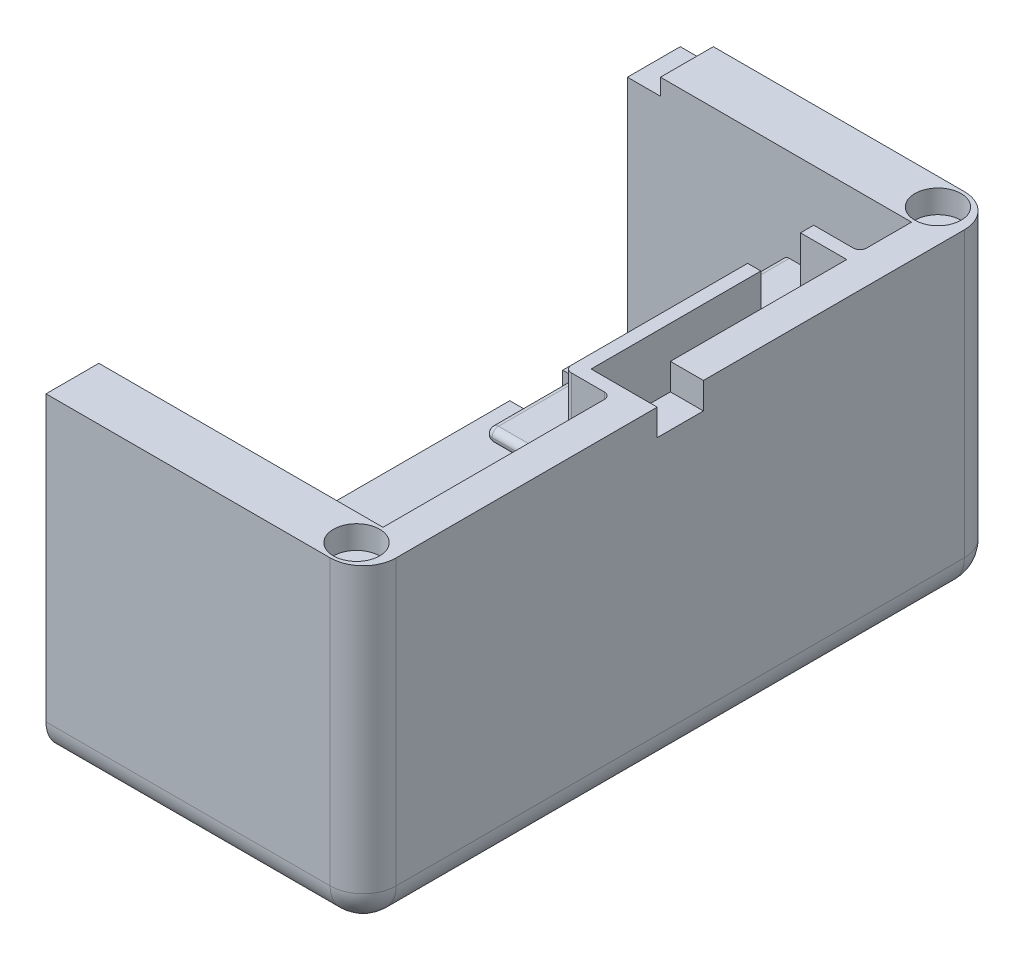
ISO-10303-21;
HEADER;
FILE_DESCRIPTION(('STEP AP214'),'2;1');
FILE_NAME('part.step','',(''),(''),'','','');
FILE_SCHEMA(('AUTOMOTIVE_DESIGN { 1 0 10303 214 1 1 1 1 }'));
ENDSEC;
DATA;
#1=APPLICATION_CONTEXT('core data for automotive mechanical design processes');
#2=APPLICATION_PROTOCOL_DEFINITION('international standard','automotive_design',2000,#1);
#3=PRODUCT_CONTEXT('',#1,'mechanical');
#4=PRODUCT('Part','Part','',(#3));
#5=PRODUCT_RELATED_PRODUCT_CATEGORY('part','',(#4));
#6=PRODUCT_DEFINITION_FORMATION('','',#4);
#7=PRODUCT_DEFINITION_CONTEXT('part definition',#1,'design');
#8=PRODUCT_DEFINITION('design','',#6,#7);
#9=PRODUCT_DEFINITION_SHAPE('','',#8);
#10=(LENGTH_UNIT() NAMED_UNIT(*) SI_UNIT(.MILLI.,.METRE.));
#11=(NAMED_UNIT(*) PLANE_ANGLE_UNIT() SI_UNIT($,.RADIAN.));
#12=(NAMED_UNIT(*) SI_UNIT($,.STERADIAN.) SOLID_ANGLE_UNIT());
#13=UNCERTAINTY_MEASURE_WITH_UNIT(LENGTH_MEASURE(1.E-05),#10,'distance_accuracy_value','');
#14=(GEOMETRIC_REPRESENTATION_CONTEXT(3) GLOBAL_UNCERTAINTY_ASSIGNED_CONTEXT((#13)) GLOBAL_UNIT_ASSIGNED_CONTEXT((#10,
#11,#12)) REPRESENTATION_CONTEXT('',''));
#15=CARTESIAN_POINT('',(0.,0.,0.));
#16=DIRECTION('',(0.,0.,1.));
#17=DIRECTION('',(1.,0.,0.));
#18=AXIS2_PLACEMENT_3D('',#15,#16,#17);
#19=CARTESIAN_POINT('',(-22.5530221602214,-3.75,88.));
#20=DIRECTION('',(0.,-1.,0.));
#21=DIRECTION('',(0.,0.,-1.));
#22=AXIS2_PLACEMENT_3D('',#19,#20,#21);
#23=PLANE('',#22);
#24=CARTESIAN_POINT('',(1.94697783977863,-3.75,17.));
#25=DIRECTION('',(0.,-1.,0.));
#26=DIRECTION('',(0.,0.,-1.));
#27=AXIS2_PLACEMENT_3D('',#24,#25,#26);
#28=CIRCLE('',#27,1.);
#29=CARTESIAN_POINT('',(2.94697783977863,-3.75,17.));
#30=VERTEX_POINT('',#29);
#31=CARTESIAN_POINT('',(1.94697783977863,-3.75,18.));
#32=VERTEX_POINT('',#31);
#33=EDGE_CURVE('E58',#30,#32,#28,.T.);
#34=ORIENTED_EDGE('',*,*,#33,.T.);
#35=CARTESIAN_POINT('',(1.94697783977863,-3.75,17.));
#36=DIRECTION('',(0.,-1.,0.));
#37=DIRECTION('',(0.,0.,-1.));
#38=AXIS2_PLACEMENT_3D('',#35,#36,#37);
#39=CIRCLE('',#38,1.);
#40=CARTESIAN_POINT('',(0.946977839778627,-3.75,17.));
#41=VERTEX_POINT('',#40);
#42=EDGE_CURVE('E49',#32,#41,#39,.T.);
#43=ORIENTED_EDGE('',*,*,#42,.T.);
#44=DIRECTION('',(0.,0.,-1.));
#45=VECTOR('',#44,1.);
#46=CARTESIAN_POINT('',(0.946977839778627,-3.75,18.));
#47=LINE('',#46,#45);
#48=CARTESIAN_POINT('',(0.946977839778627,-3.75,8.));
#49=VERTEX_POINT('',#48);
#50=EDGE_CURVE('E512',#41,#49,#47,.T.);
#51=ORIENTED_EDGE('',*,*,#50,.T.);
#52=DIRECTION('',(-1.,0.,0.));
#53=VECTOR('',#52,1.);
#54=CARTESIAN_POINT('',(-22.5530221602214,-3.75,8.));
#55=LINE('',#54,#53);
#56=CARTESIAN_POINT('',(-22.5530221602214,-3.75,8.));
#57=VERTEX_POINT('',#56);
#58=EDGE_CURVE('E664',#49,#57,#55,.T.);
#59=ORIENTED_EDGE('',*,*,#58,.T.);
#60=DIRECTION('',(0.,0.,-1.));
#61=VECTOR('',#60,1.);
#62=CARTESIAN_POINT('',(-22.5530221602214,-3.75,88.));
#63=LINE('',#62,#61);
#64=CARTESIAN_POINT('',(-22.5530221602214,-3.75,14.8062937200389));
#65=VERTEX_POINT('',#64);
#66=EDGE_CURVE('E938',#65,#57,#63,.T.);
#67=ORIENTED_EDGE('',*,*,#66,.F.);
#68=DIRECTION('',(1.,0.,0.));
#69=VECTOR('',#68,1.);
#70=CARTESIAN_POINT('',(-22.5530221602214,-3.75,14.8062937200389));
#71=LINE('',#70,#69);
#72=CARTESIAN_POINT('',(-12.5530221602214,-3.75,14.8062937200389));
#73=VERTEX_POINT('',#72);
#74=EDGE_CURVE('E1042',#65,#73,#71,.T.);
#75=ORIENTED_EDGE('',*,*,#74,.T.);
#76=CARTESIAN_POINT('',(-12.5530221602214,-3.75,16.8062937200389));
#77=DIRECTION('',(0.,-1.,0.));
#78=DIRECTION('',(0.,0.,-1.));
#79=AXIS2_PLACEMENT_3D('',#76,#77,#78);
#80=CIRCLE('',#79,2.);
#81=CARTESIAN_POINT('',(-10.5530221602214,-3.75,16.8062937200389));
#82=VERTEX_POINT('',#81);
#83=EDGE_CURVE('E1039',#82,#73,#80,.F.);
#84=ORIENTED_EDGE('',*,*,#83,.F.);
#85=DIRECTION('',(0.,0.,-1.));
#86=VECTOR('',#85,1.);
#87=CARTESIAN_POINT('',(-10.5530221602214,-3.75,53.5));
#88=LINE('',#87,#86);
#89=CARTESIAN_POINT('',(-10.5530221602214,-3.75,54.5));
#90=VERTEX_POINT('',#89);
#91=EDGE_CURVE('E1037',#82,#90,#88,.F.);
#92=ORIENTED_EDGE('',*,*,#91,.T.);
#93=DIRECTION('',(-1.,0.,0.));
#94=VECTOR('',#93,1.);
#95=CARTESIAN_POINT('',(-22.5530221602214,-3.75,54.5));
#96=LINE('',#95,#94);
#97=CARTESIAN_POINT('',(-22.5530221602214,-3.75,54.5));
#98=VERTEX_POINT('',#97);
#99=EDGE_CURVE('E1035',#90,#98,#96,.T.);
#100=ORIENTED_EDGE('',*,*,#99,.T.);
#101=CARTESIAN_POINT('',(-22.5530221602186,-3.75,77.3500000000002));
#102=VERTEX_POINT('',#101);
#103=EDGE_CURVE('E1226',#102,#98,#63,.T.);
#104=ORIENTED_EDGE('',*,*,#103,.F.);
#105=DIRECTION('',(-1.,0.,0.));
#106=VECTOR('',#105,1.);
#107=CARTESIAN_POINT('',(-22.5530221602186,-3.75,77.3500000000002));
#108=LINE('',#107,#106);
#109=CARTESIAN_POINT('',(2.08697783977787,-3.75,77.3500000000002));
#110=VERTEX_POINT('',#109);
#111=EDGE_CURVE('E710',#110,#102,#108,.T.);
#112=ORIENTED_EDGE('',*,*,#111,.F.);
#113=DIRECTION('',(0.,0.,-1.));
#114=VECTOR('',#113,1.);
#115=CARTESIAN_POINT('',(2.08697783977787,-3.75,79.3500000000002));
#116=LINE('',#115,#114);
#117=CARTESIAN_POINT('',(2.08697783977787,-3.75,79.3500000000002));
#118=VERTEX_POINT('',#117);
#119=EDGE_CURVE('E708',#118,#110,#116,.T.);
#120=ORIENTED_EDGE('',*,*,#119,.F.);
#121=DIRECTION('',(1.,0.,0.));
#122=VECTOR('',#121,1.);
#123=CARTESIAN_POINT('',(-22.5530221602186,-3.75,79.3500000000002));
#124=LINE('',#123,#122);
#125=CARTESIAN_POINT('',(-22.5530221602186,-3.75,79.3500000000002));
#126=VERTEX_POINT('',#125);
#127=EDGE_CURVE('E701',#126,#118,#124,.T.);
#128=ORIENTED_EDGE('',*,*,#127,.F.);
#129=CARTESIAN_POINT('',(-22.5530221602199,-3.75,81.0000000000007));
#130=VERTEX_POINT('',#129);
#131=EDGE_CURVE('E947',#130,#126,#63,.T.);
#132=ORIENTED_EDGE('',*,*,#131,.F.);
#133=DIRECTION('',(-1.,0.,0.));
#134=VECTOR('',#133,1.);
#135=CARTESIAN_POINT('',(-22.5530221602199,-3.75,81.0000000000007));
#136=LINE('',#135,#134);
#137=CARTESIAN_POINT('',(2.08697783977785,-3.75,81.0000000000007));
#138=VERTEX_POINT('',#137);
#139=EDGE_CURVE('E736',#138,#130,#136,.T.);
#140=ORIENTED_EDGE('',*,*,#139,.F.);
#141=DIRECTION('',(0.,0.,-1.));
#142=VECTOR('',#141,1.);
#143=CARTESIAN_POINT('',(2.08697783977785,-3.75,83.0000000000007));
#144=LINE('',#143,#142);
#145=CARTESIAN_POINT('',(2.08697783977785,-3.75,83.0000000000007));
#146=VERTEX_POINT('',#145);
#147=EDGE_CURVE('E734',#146,#138,#144,.T.);
#148=ORIENTED_EDGE('',*,*,#147,.F.);
#149=DIRECTION('',(1.,0.,0.));
#150=VECTOR('',#149,1.);
#151=CARTESIAN_POINT('',(-22.5530221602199,-3.75,83.0000000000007));
#152=LINE('',#151,#150);
#153=CARTESIAN_POINT('',(-22.5530221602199,-3.75,83.0000000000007));
#154=VERTEX_POINT('',#153);
#155=EDGE_CURVE('E727',#154,#146,#152,.T.);
#156=ORIENTED_EDGE('',*,*,#155,.F.);
#157=CARTESIAN_POINT('',(-22.5530221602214,-3.75,88.));
#158=VERTEX_POINT('',#157);
#159=EDGE_CURVE('E943',#158,#154,#63,.T.);
#160=ORIENTED_EDGE('',*,*,#159,.F.);
#161=DIRECTION('',(-1.,0.,0.));
#162=VECTOR('',#161,1.);
#163=CARTESIAN_POINT('',(-22.5530221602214,-3.75,88.));
#164=LINE('',#163,#162);
#165=CARTESIAN_POINT('',(20.4469778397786,-3.75,88.));
#166=VERTEX_POINT('',#165);
#167=EDGE_CURVE('E935',#166,#158,#164,.T.);
#168=ORIENTED_EDGE('',*,*,#167,.F.);
#169=DIRECTION('',(0.,0.,-1.));
#170=VECTOR('',#169,1.);
#171=CARTESIAN_POINT('',(20.4469778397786,-3.75,88.));
#172=LINE('',#171,#170);
#173=CARTESIAN_POINT('',(20.4469778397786,-3.75,55.));
#174=VERTEX_POINT('',#173);
#175=EDGE_CURVE('E949',#166,#174,#172,.T.);
#176=ORIENTED_EDGE('',*,*,#175,.T.);
#177=DIRECTION('',(-1.,0.,0.));
#178=VECTOR('',#177,1.);
#179=CARTESIAN_POINT('',(20.4469778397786,-3.75000000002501,55.));
#180=LINE('',#179,#178);
#181=CARTESIAN_POINT('',(16.6969778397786,-3.75000000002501,55.));
#182=VERTEX_POINT('',#181);
#183=EDGE_CURVE('E675',#174,#182,#180,.T.);
#184=ORIENTED_EDGE('',*,*,#183,.T.);
#185=CARTESIAN_POINT('',(16.6969778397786,-3.75,54.));
#186=DIRECTION('',(0.,-1.,0.));
#187=DIRECTION('',(0.,0.,-1.));
#188=AXIS2_PLACEMENT_3D('',#185,#186,#187);
#189=CIRCLE('',#188,1.);
#190=CARTESIAN_POINT('',(15.6969778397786,-3.75,54.));
#191=VERTEX_POINT('',#190);
#192=EDGE_CURVE('E532',#182,#191,#189,.T.);
#193=ORIENTED_EDGE('',*,*,#192,.T.);
#194=CARTESIAN_POINT('',(16.6969778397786,-3.75000000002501,54.));
#195=DIRECTION('',(0.,-1.,0.));
#196=DIRECTION('',(0.,0.,-1.));
#197=AXIS2_PLACEMENT_3D('',#194,#195,#196);
#198=CIRCLE('',#197,1.);
#199=CARTESIAN_POINT('',(16.6969778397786,-3.75000000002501,53.));
#200=VERTEX_POINT('',#199);
#201=EDGE_CURVE('E607',#191,#200,#198,.T.);
#202=ORIENTED_EDGE('',*,*,#201,.T.);
#203=DIRECTION('',(1.,0.,0.));
#204=VECTOR('',#203,1.);
#205=CARTESIAN_POINT('',(20.4469778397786,-3.75000000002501,53.));
#206=LINE('',#205,#204);
#207=CARTESIAN_POINT('',(20.4469778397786,-3.75,53.));
#208=VERTEX_POINT('',#207);
#209=EDGE_CURVE('E680',#200,#208,#206,.T.);
#210=ORIENTED_EDGE('',*,*,#209,.T.);
#211=CARTESIAN_POINT('',(20.4469778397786,-3.75,8.));
#212=VERTEX_POINT('',#211);
#213=EDGE_CURVE('E946',#208,#212,#172,.T.);
#214=ORIENTED_EDGE('',*,*,#213,.T.);
#215=CARTESIAN_POINT('',(2.94697783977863,-3.75,8.));
#216=VERTEX_POINT('',#215);
#217=EDGE_CURVE('E635',#212,#216,#55,.T.);
#218=ORIENTED_EDGE('',*,*,#217,.T.);
#219=DIRECTION('',(0.,0.,-1.));
#220=VECTOR('',#219,1.);
#221=CARTESIAN_POINT('',(2.94697783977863,-3.75,18.));
#222=LINE('',#221,#220);
#223=EDGE_CURVE('E527',#30,#216,#222,.T.);
#224=ORIENTED_EDGE('',*,*,#223,.F.);
#225=EDGE_LOOP('',(#34,#43,#51,#59,#67,#75,#84,#92,#100,#104,#112,#120,#128,#132,#140,#148,#156,
#160,#168,#176,#184,#193,#202,#210,#214,#218,#224));
#226=FACE_BOUND('',#225,.T.);
#227=ADVANCED_FACE('F39',(#226),#23,.F.);
#228=CARTESIAN_POINT('',(0.,0.,8.));
#229=DIRECTION('',(0.,0.,-1.));
#230=DIRECTION('',(-1.,0.,0.));
#231=AXIS2_PLACEMENT_3D('',#228,#229,#230);
#232=PLANE('',#231);
#233=ORIENTED_EDGE('',*,*,#58,.F.);
#234=DIRECTION('',(0.,-1.,0.));
#235=VECTOR('',#234,1.);
#236=CARTESIAN_POINT('',(0.946977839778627,0.,8.));
#237=LINE('',#236,#235);
#238=CARTESIAN_POINT('',(0.946977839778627,24.25,8.));
#239=VERTEX_POINT('',#238);
#240=EDGE_CURVE('E524',#239,#49,#237,.T.);
#241=ORIENTED_EDGE('',*,*,#240,.F.);
#242=CARTESIAN_POINT('',(1.94697783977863,24.25,8.));
#243=DIRECTION('',(0.,0.,-1.));
#244=DIRECTION('',(-1.,0.,0.));
#245=AXIS2_PLACEMENT_3D('',#242,#243,#244);
#246=CIRCLE('',#245,1.);
#247=CARTESIAN_POINT('',(1.94697783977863,25.25,8.));
#248=VERTEX_POINT('',#247);
#249=EDGE_CURVE('E11',#239,#248,#246,.T.);
#250=ORIENTED_EDGE('',*,*,#249,.T.);
#251=DIRECTION('',(1.,0.,0.));
#252=VECTOR('',#251,1.);
#253=CARTESIAN_POINT('',(0.946977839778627,25.25,8.));
#254=LINE('',#253,#252);
#255=CARTESIAN_POINT('',(20.4469778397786,25.25,8.));
#256=VERTEX_POINT('',#255);
#257=EDGE_CURVE('E668',#248,#256,#254,.T.);
#258=ORIENTED_EDGE('',*,*,#257,.T.);
#259=DIRECTION('',(0.,-1.,0.));
#260=VECTOR('',#259,1.);
#261=CARTESIAN_POINT('',(20.4469778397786,-3.75,8.));
#262=LINE('',#261,#260);
#263=CARTESIAN_POINT('',(20.4469778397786,39.25,8.));
#264=VERTEX_POINT('',#263);
#265=EDGE_CURVE('E939',#264,#256,#262,.T.);
#266=ORIENTED_EDGE('',*,*,#265,.F.);
#267=DIRECTION('',(-1.,0.,0.));
#268=VECTOR('',#267,1.);
#269=CARTESIAN_POINT('',(-22.5530221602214,39.25,8.));
#270=LINE('',#269,#268);
#271=CARTESIAN_POINT('',(-17.5530221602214,39.25,8.));
#272=VERTEX_POINT('',#271);
#273=EDGE_CURVE('E960',#264,#272,#270,.T.);
#274=ORIENTED_EDGE('',*,*,#273,.T.);
#275=DIRECTION('',(0.,-1.,0.));
#276=VECTOR('',#275,1.);
#277=CARTESIAN_POINT('',(-17.5530221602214,0.,8.));
#278=LINE('',#277,#276);
#279=CARTESIAN_POINT('',(-17.5530221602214,36.75,8.));
#280=VERTEX_POINT('',#279);
#281=EDGE_CURVE('E753',#272,#280,#278,.T.);
#282=ORIENTED_EDGE('',*,*,#281,.T.);
#283=DIRECTION('',(-1.,0.,0.));
#284=VECTOR('',#283,1.);
#285=CARTESIAN_POINT('',(0.,36.75,8.));
#286=LINE('',#285,#284);
#287=CARTESIAN_POINT('',(-22.5530221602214,36.75,8.));
#288=VERTEX_POINT('',#287);
#289=EDGE_CURVE('E745',#280,#288,#286,.T.);
#290=ORIENTED_EDGE('',*,*,#289,.T.);
#291=DIRECTION('',(0.,-1.,0.));
#292=VECTOR('',#291,1.);
#293=CARTESIAN_POINT('',(-22.5530221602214,-8.75,8.));
#294=LINE('',#293,#292);
#295=EDGE_CURVE('E958',#288,#57,#294,.T.);
#296=ORIENTED_EDGE('',*,*,#295,.T.);
#297=EDGE_LOOP('',(#233,#241,#250,#258,#266,#274,#282,#290,#296));
#298=FACE_BOUND('',#297,.T.);
#299=ADVANCED_FACE('F661',(#298),#232,.F.);
#300=CARTESIAN_POINT('',(20.4469778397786,-3.75,88.));
#301=DIRECTION('',(1.,0.,0.));
#302=DIRECTION('',(0.,0.,-1.));
#303=AXIS2_PLACEMENT_3D('',#300,#301,#302);
#304=PLANE('',#303);
#305=DIRECTION('',(0.,1.,0.));
#306=VECTOR('',#305,1.);
#307=CARTESIAN_POINT('',(20.4469778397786,-500000.,53.0000000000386));
#308=LINE('',#307,#306);
#309=CARTESIAN_POINT('',(20.4469778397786,23.25,53.));
#310=VERTEX_POINT('',#309);
#311=EDGE_CURVE('E2366',#208,#310,#308,.T.);
#312=ORIENTED_EDGE('',*,*,#311,.T.);
#313=DIRECTION('',(0.,0.,-1.));
#314=VECTOR('',#313,1.);
#315=CARTESIAN_POINT('',(20.4469778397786,23.25,0.));
#316=LINE('',#315,#314);
#317=CARTESIAN_POINT('',(20.4469778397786,23.25,8.));
#318=VERTEX_POINT('',#317);
#319=EDGE_CURVE('E677',#310,#318,#316,.T.);
#320=ORIENTED_EDGE('',*,*,#319,.T.);
#321=EDGE_CURVE('E931',#318,#212,#262,.T.);
#322=ORIENTED_EDGE('',*,*,#321,.T.);
#323=ORIENTED_EDGE('',*,*,#213,.F.);
#324=EDGE_LOOP('',(#312,#320,#322,#323));
#325=FACE_BOUND('',#324,.T.);
#326=ADVANCED_FACE('F1376',(#325),#304,.F.);
#327=DIRECTION('',(0.,0.,-1.));
#328=VECTOR('',#327,1.);
#329=CARTESIAN_POINT('',(20.4469778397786,27.25,88.));
#330=LINE('',#329,#328);
#331=CARTESIAN_POINT('',(20.4469778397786,27.25,52.5));
#332=VERTEX_POINT('',#331);
#333=CARTESIAN_POINT('',(20.4469778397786,27.25,14.8062937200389));
#334=VERTEX_POINT('',#333);
#335=EDGE_CURVE('E1106',#332,#334,#330,.T.);
#336=ORIENTED_EDGE('',*,*,#335,.T.);
#337=DIRECTION('',(0.,-1.,0.));
#338=VECTOR('',#337,1.);
#339=CARTESIAN_POINT('',(20.4469778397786,39.25,14.8062937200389));
#340=LINE('',#339,#338);
#341=CARTESIAN_POINT('',(20.4469778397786,39.25,14.8062937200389));
#342=VERTEX_POINT('',#341);
#343=EDGE_CURVE('E588',#334,#342,#340,.F.);
#344=ORIENTED_EDGE('',*,*,#343,.T.);
#345=DIRECTION('',(0.,0.,-1.));
#346=VECTOR('',#345,1.);
#347=CARTESIAN_POINT('',(20.4469778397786,39.25,88.));
#348=LINE('',#347,#346);
#349=EDGE_CURVE('E952',#342,#264,#348,.T.);
#350=ORIENTED_EDGE('',*,*,#349,.T.);
#351=ORIENTED_EDGE('',*,*,#265,.T.);
#352=DIRECTION('',(0.,0.,1.));
#353=VECTOR('',#352,1.);
#354=CARTESIAN_POINT('',(20.4469778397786,25.25,0.));
#355=LINE('',#354,#353);
#356=CARTESIAN_POINT('',(20.4469778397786,25.25,55.));
#357=VERTEX_POINT('',#356);
#358=EDGE_CURVE('E666',#256,#357,#355,.T.);
#359=ORIENTED_EDGE('',*,*,#358,.T.);
#360=DIRECTION('',(0.,1.,0.));
#361=VECTOR('',#360,1.);
#362=CARTESIAN_POINT('',(20.4469778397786,0.,55.));
#363=LINE('',#362,#361);
#364=EDGE_CURVE('E671',#174,#357,#363,.T.);
#365=ORIENTED_EDGE('',*,*,#364,.F.);
#366=ORIENTED_EDGE('',*,*,#175,.F.);
#367=DIRECTION('',(0.,-1.,0.));
#368=VECTOR('',#367,1.);
#369=CARTESIAN_POINT('',(20.4469778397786,-3.75,88.));
#370=LINE('',#369,#368);
#371=CARTESIAN_POINT('',(20.4469778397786,39.25,88.));
#372=VERTEX_POINT('',#371);
#373=EDGE_CURVE('E932',#372,#166,#370,.T.);
#374=ORIENTED_EDGE('',*,*,#373,.F.);
#375=CARTESIAN_POINT('',(20.4469778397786,39.25,54.5));
#376=VERTEX_POINT('',#375);
#377=EDGE_CURVE('E953',#372,#376,#348,.T.);
#378=ORIENTED_EDGE('',*,*,#377,.T.);
#379=DIRECTION('',(0.,1.,0.));
#380=VECTOR('',#379,1.);
#381=CARTESIAN_POINT('',(20.4469778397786,27.25,54.5));
#382=LINE('',#381,#380);
#383=CARTESIAN_POINT('',(20.4469778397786,29.25,54.5));
#384=VERTEX_POINT('',#383);
#385=EDGE_CURVE('E1125',#376,#384,#382,.F.);
#386=ORIENTED_EDGE('',*,*,#385,.T.);
#387=CARTESIAN_POINT('',(20.4469778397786,29.25,52.5));
#388=DIRECTION('',(1.,0.,0.));
#389=DIRECTION('',(0.,0.,-1.));
#390=AXIS2_PLACEMENT_3D('',#387,#388,#389);
#391=CIRCLE('',#390,2.);
#392=EDGE_CURVE('E1126',#384,#332,#391,.T.);
#393=ORIENTED_EDGE('',*,*,#392,.T.);
#394=EDGE_LOOP('',(#336,#344,#350,#351,#359,#365,#366,#374,#378,#386,#393));
#395=FACE_BOUND('',#394,.T.);
#396=ADVANCED_FACE('F1138',(#395),#304,.F.);
#397=CARTESIAN_POINT('',(0.946977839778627,23.25,0.));
#398=DIRECTION('',(0.,-1.,0.));
#399=DIRECTION('',(0.,0.,-1.));
#400=AXIS2_PLACEMENT_3D('',#397,#398,#399);
#401=PLANE('',#400);
#402=DIRECTION('',(0.,0.,1.));
#403=VECTOR('',#402,1.);
#404=CARTESIAN_POINT('',(15.6969778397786,23.25,0.));
#405=LINE('',#404,#403);
#406=CARTESIAN_POINT('',(15.6969778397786,23.25,52.));
#407=VERTEX_POINT('',#406);
#408=CARTESIAN_POINT('',(15.6969778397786,23.25,54.));
#409=VERTEX_POINT('',#408);
#410=EDGE_CURVE('E601',#407,#409,#405,.T.);
#411=ORIENTED_EDGE('',*,*,#410,.F.);
#412=DIRECTION('',(1.,0.,0.));
#413=VECTOR('',#412,1.);
#414=CARTESIAN_POINT('',(0.946977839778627,23.25,52.));
#415=LINE('',#414,#413);
#416=CARTESIAN_POINT('',(1.94697783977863,23.25,52.));
#417=VERTEX_POINT('',#416);
#418=EDGE_CURVE('E617',#407,#417,#415,.F.);
#419=ORIENTED_EDGE('',*,*,#418,.T.);
#420=DIRECTION('',(0.,0.,-1.));
#421=VECTOR('',#420,1.);
#422=CARTESIAN_POINT('',(1.94697783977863,23.25,0.));
#423=LINE('',#422,#421);
#424=CARTESIAN_POINT('',(1.94697783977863,23.25,18.));
#425=VERTEX_POINT('',#424);
#426=EDGE_CURVE('E615',#417,#425,#423,.T.);
#427=ORIENTED_EDGE('',*,*,#426,.T.);
#428=CARTESIAN_POINT('',(1.94697783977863,23.25,17.));
#429=DIRECTION('',(0.,-1.,0.));
#430=DIRECTION('',(0.,0.,-1.));
#431=AXIS2_PLACEMENT_3D('',#428,#429,#430);
#432=CIRCLE('',#431,1.);
#433=CARTESIAN_POINT('',(2.94697783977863,23.25,17.));
#434=VERTEX_POINT('',#433);
#435=EDGE_CURVE('E517',#425,#434,#432,.F.);
#436=ORIENTED_EDGE('',*,*,#435,.T.);
#437=DIRECTION('',(0.,0.,-1.));
#438=VECTOR('',#437,1.);
#439=CARTESIAN_POINT('',(2.94697783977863,23.25,18.));
#440=LINE('',#439,#438);
#441=CARTESIAN_POINT('',(2.94697783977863,23.25,8.));
#442=VERTEX_POINT('',#441);
#443=EDGE_CURVE('E630',#434,#442,#440,.T.);
#444=ORIENTED_EDGE('',*,*,#443,.T.);
#445=DIRECTION('',(1.,0.,0.));
#446=VECTOR('',#445,1.);
#447=CARTESIAN_POINT('',(0.946977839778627,23.25,8.));
#448=LINE('',#447,#446);
#449=EDGE_CURVE('E665',#442,#318,#448,.T.);
#450=ORIENTED_EDGE('',*,*,#449,.T.);
#451=ORIENTED_EDGE('',*,*,#319,.F.);
#452=DIRECTION('',(1.,0.,0.));
#453=VECTOR('',#452,1.);
#454=CARTESIAN_POINT('',(20.4469778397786,23.25,53.));
#455=LINE('',#454,#453);
#456=CARTESIAN_POINT('',(16.6969778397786,23.25,53.));
#457=VERTEX_POINT('',#456);
#458=EDGE_CURVE('E526',#457,#310,#455,.T.);
#459=ORIENTED_EDGE('',*,*,#458,.F.);
#460=CARTESIAN_POINT('',(16.6969778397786,23.2500000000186,54.));
#461=DIRECTION('',(0.,-1.,0.));
#462=DIRECTION('',(0.,0.,-1.));
#463=AXIS2_PLACEMENT_3D('',#460,#461,#462);
#464=CIRCLE('',#463,1.);
#465=EDGE_CURVE('E604',#457,#409,#464,.F.);
#466=ORIENTED_EDGE('',*,*,#465,.T.);
#467=EDGE_LOOP('',(#411,#419,#427,#436,#444,#450,#451,#459,#466));
#468=FACE_BOUND('',#467,.T.);
#469=ADVANCED_FACE('F638',(#468),#401,.T.);
#470=CARTESIAN_POINT('',(-22.5530221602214,-8.75,8.));
#471=DIRECTION('',(1.,0.,0.));
#472=DIRECTION('',(0.,0.,-1.));
#473=AXIS2_PLACEMENT_3D('',#470,#471,#472);
#474=PLANE('',#473);
#475=CARTESIAN_POINT('',(-22.5530221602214,-3.75000000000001,4.));
#476=DIRECTION('',(-1.,0.,0.));
#477=DIRECTION('',(0.,0.,-1.));
#478=AXIS2_PLACEMENT_3D('',#475,#476,#477);
#479=CIRCLE('',#478,3.5);
#480=CARTESIAN_POINT('',(-22.5530221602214,-3.75000000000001,0.500000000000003));
#481=VERTEX_POINT('',#480);
#482=EDGE_CURVE('E760',#481,#481,#479,.T.);
#483=ORIENTED_EDGE('',*,*,#482,.F.);
#484=EDGE_LOOP('',(#483));
#485=FACE_BOUND('',#484,.T.);
#486=DIRECTION('',(0.,0.,-1.));
#487=VECTOR('',#486,1.);
#488=CARTESIAN_POINT('',(-22.5530221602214,3.24999999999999,0.));
#489=LINE('',#488,#487);
#490=CARTESIAN_POINT('',(-22.5530221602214,3.24999999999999,17.8062937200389));
#491=VERTEX_POINT('',#490);
#492=CARTESIAN_POINT('',(-22.5530221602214,3.24999999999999,16.8062937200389));
#493=VERTEX_POINT('',#492);
#494=EDGE_CURVE('E806',#491,#493,#489,.T.);
#495=ORIENTED_EDGE('',*,*,#494,.T.);
#496=CARTESIAN_POINT('',(-22.5530221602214,2.25,16.8062937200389));
#497=DIRECTION('',(1.,0.,0.));
#498=DIRECTION('',(0.,0.,-1.));
#499=AXIS2_PLACEMENT_3D('',#496,#497,#498);
#500=CIRCLE('',#499,1.);
#501=CARTESIAN_POINT('',(-22.5530221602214,2.25,15.8062937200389));
#502=VERTEX_POINT('',#501);
#503=EDGE_CURVE('E1063',#493,#502,#500,.F.);
#504=ORIENTED_EDGE('',*,*,#503,.T.);
#505=DIRECTION('',(0.,-1.,0.));
#506=VECTOR('',#505,1.);
#507=CARTESIAN_POINT('',(-22.5530221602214,3.24999999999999,15.8062937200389));
#508=LINE('',#507,#506);
#509=CARTESIAN_POINT('',(-22.5530221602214,-2.75,15.8062937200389));
#510=VERTEX_POINT('',#509);
#511=EDGE_CURVE('E805',#502,#510,#508,.T.);
#512=ORIENTED_EDGE('',*,*,#511,.T.);
#513=CARTESIAN_POINT('',(-22.5530221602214,-2.75,14.8062937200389));
#514=DIRECTION('',(1.,0.,0.));
#515=DIRECTION('',(0.,0.,-1.));
#516=AXIS2_PLACEMENT_3D('',#513,#514,#515);
#517=CIRCLE('',#516,1.);
#518=EDGE_CURVE('E1071',#510,#65,#517,.T.);
#519=ORIENTED_EDGE('',*,*,#518,.T.);
#520=ORIENTED_EDGE('',*,*,#66,.T.);
#521=ORIENTED_EDGE('',*,*,#295,.F.);
#522=DIRECTION('',(0.,0.,-1.));
#523=VECTOR('',#522,1.);
#524=CARTESIAN_POINT('',(-22.5530221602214,36.75,10.));
#525=LINE('',#524,#523);
#526=CARTESIAN_POINT('',(-22.5530221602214,36.75,0.));
#527=VERTEX_POINT('',#526);
#528=EDGE_CURVE('E746',#288,#527,#525,.T.);
#529=ORIENTED_EDGE('',*,*,#528,.T.);
#530=DIRECTION('',(0.,-1.,0.));
#531=VECTOR('',#530,1.);
#532=CARTESIAN_POINT('',(-22.5530221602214,-8.75,0.));
#533=LINE('',#532,#531);
#534=CARTESIAN_POINT('',(-22.5530221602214,-3.75,0.));
#535=VERTEX_POINT('',#534);
#536=EDGE_CURVE('E956',#527,#535,#533,.T.);
#537=ORIENTED_EDGE('',*,*,#536,.T.);
#538=CARTESIAN_POINT('',(-22.5530221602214,-3.75,5.));
#539=DIRECTION('',(1.,0.,0.));
#540=DIRECTION('',(0.,0.,-1.));
#541=AXIS2_PLACEMENT_3D('',#538,#539,#540);
#542=CIRCLE('',#541,5.);
#543=CARTESIAN_POINT('',(-22.5530221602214,-8.75,5.));
#544=VERTEX_POINT('',#543);
#545=EDGE_CURVE('E985',#535,#544,#542,.F.);
#546=ORIENTED_EDGE('',*,*,#545,.T.);
#547=DIRECTION('',(0.,0.,-1.));
#548=VECTOR('',#547,1.);
#549=CARTESIAN_POINT('',(-22.5530221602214,-8.75,8.));
#550=LINE('',#549,#548);
#551=CARTESIAN_POINT('',(-22.5530221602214,-8.75000000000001,44.5));
#552=VERTEX_POINT('',#551);
#553=EDGE_CURVE('E971',#552,#544,#550,.T.);
#554=ORIENTED_EDGE('',*,*,#553,.F.);
#555=DIRECTION('',(0.,-1.,0.));
#556=VECTOR('',#555,1.);
#557=CARTESIAN_POINT('',(-22.5530221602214,1.24999999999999,44.5));
#558=LINE('',#557,#556);
#559=CARTESIAN_POINT('',(-22.5530221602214,-3.75,44.5));
#560=VERTEX_POINT('',#559);
#561=EDGE_CURVE('E839',#560,#552,#558,.T.);
#562=ORIENTED_EDGE('',*,*,#561,.F.);
#563=CARTESIAN_POINT('',(-22.5530221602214,-3.75000000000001,17.8062937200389));
#564=VERTEX_POINT('',#563);
#565=EDGE_CURVE('E948',#560,#564,#63,.T.);
#566=ORIENTED_EDGE('',*,*,#565,.T.);
#567=DIRECTION('',(0.,-1.,0.));
#568=VECTOR('',#567,1.);
#569=CARTESIAN_POINT('',(-22.5530221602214,3.24999999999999,17.8062937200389));
#570=LINE('',#569,#568);
#571=EDGE_CURVE('E827',#491,#564,#570,.T.);
#572=ORIENTED_EDGE('',*,*,#571,.F.);
#573=EDGE_LOOP('',(#495,#504,#512,#519,#520,#521,#529,#537,#546,#554,#562,#566,#572));
#574=FACE_BOUND('',#573,.T.);
#575=ADVANCED_FACE('F1222',(#485,#574),#474,.F.);
#576=CARTESIAN_POINT('',(16.6969778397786,3.25000000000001,0.));
#577=DIRECTION('',(0.,1.,0.));
#578=DIRECTION('',(0.,0.,1.));
#579=AXIS2_PLACEMENT_3D('',#576,#577,#578);
#580=PLANE('',#579);
#581=DIRECTION('',(0.,0.,-1.));
#582=VECTOR('',#581,1.);
#583=CARTESIAN_POINT('',(-12.5530221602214,3.25,15.8062937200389));
#584=LINE('',#583,#582);
#585=CARTESIAN_POINT('',(-12.5530221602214,3.25,52.5));
#586=VERTEX_POINT('',#585);
#587=CARTESIAN_POINT('',(-12.5530221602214,3.25,16.8062937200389));
#588=VERTEX_POINT('',#587);
#589=EDGE_CURVE('E1059',#586,#588,#584,.T.);
#590=ORIENTED_EDGE('',*,*,#589,.T.);
#591=DIRECTION('',(1.,0.,0.));
#592=VECTOR('',#591,1.);
#593=CARTESIAN_POINT('',(16.6969778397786,3.25000000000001,16.8062937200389));
#594=LINE('',#593,#592);
#595=EDGE_CURVE('E1061',#588,#493,#594,.F.);
#596=ORIENTED_EDGE('',*,*,#595,.T.);
#597=ORIENTED_EDGE('',*,*,#494,.F.);
#598=DIRECTION('',(1.,0.,0.));
#599=VECTOR('',#598,1.);
#600=CARTESIAN_POINT('',(16.6969778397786,3.25000000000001,17.8062937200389));
#601=LINE('',#600,#599);
#602=CARTESIAN_POINT('',(-13.5530221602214,3.25,17.8062937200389));
#603=VERTEX_POINT('',#602);
#604=EDGE_CURVE('E786',#491,#603,#601,.T.);
#605=ORIENTED_EDGE('',*,*,#604,.T.);
#606=DIRECTION('',(0.,0.,-1.));
#607=VECTOR('',#606,1.);
#608=CARTESIAN_POINT('',(-13.5530221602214,3.25,0.));
#609=LINE('',#608,#607);
#610=CARTESIAN_POINT('',(-13.5530221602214,3.25,25.8062937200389));
#611=VERTEX_POINT('',#610);
#612=EDGE_CURVE('E783',#611,#603,#609,.T.);
#613=ORIENTED_EDGE('',*,*,#612,.F.);
#614=DIRECTION('',(1.,0.,0.));
#615=VECTOR('',#614,1.);
#616=CARTESIAN_POINT('',(16.6969778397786,3.25000000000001,25.8062937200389));
#617=LINE('',#616,#615);
#618=CARTESIAN_POINT('',(-22.5530221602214,3.24999999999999,25.8062937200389));
#619=VERTEX_POINT('',#618);
#620=EDGE_CURVE('E778',#619,#611,#617,.T.);
#621=ORIENTED_EDGE('',*,*,#620,.F.);
#622=CARTESIAN_POINT('',(-22.5530221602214,3.24999999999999,52.5));
#623=VERTEX_POINT('',#622);
#624=EDGE_CURVE('E803',#623,#619,#489,.T.);
#625=ORIENTED_EDGE('',*,*,#624,.F.);
#626=DIRECTION('',(-1.,0.,0.));
#627=VECTOR('',#626,1.);
#628=CARTESIAN_POINT('',(16.6969778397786,3.25000000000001,52.5));
#629=LINE('',#628,#627);
#630=EDGE_CURVE('E1057',#623,#586,#629,.F.);
#631=ORIENTED_EDGE('',*,*,#630,.T.);
#632=EDGE_LOOP('',(#590,#596,#597,#605,#613,#621,#625,#631));
#633=FACE_BOUND('',#632,.T.);
#634=ADVANCED_FACE('F1299',(#633),#580,.T.);
#635=DIRECTION('',(1.,0.,0.));
#636=VECTOR('',#635,1.);
#637=CARTESIAN_POINT('',(16.6969778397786,-3.74999999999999,17.8062937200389));
#638=LINE('',#637,#636);
#639=CARTESIAN_POINT('',(-13.5530221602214,-3.75,17.8062937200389));
#640=VERTEX_POINT('',#639);
#641=EDGE_CURVE('E802',#564,#640,#638,.T.);
#642=ORIENTED_EDGE('',*,*,#641,.F.);
#643=ORIENTED_EDGE('',*,*,#565,.F.);
#644=DIRECTION('',(-1.,0.,0.));
#645=VECTOR('',#644,1.);
#646=CARTESIAN_POINT('',(-22.5530221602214,-3.75,44.5));
#647=LINE('',#646,#645);
#648=CARTESIAN_POINT('',(-18.5530221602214,-3.75,44.5));
#649=VERTEX_POINT('',#648);
#650=EDGE_CURVE('E1031',#649,#560,#647,.T.);
#651=ORIENTED_EDGE('',*,*,#650,.F.);
#652=DIRECTION('',(0.,0.,-1.));
#653=VECTOR('',#652,1.);
#654=CARTESIAN_POINT('',(-18.5530221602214,-3.75,88.));
#655=LINE('',#654,#653);
#656=CARTESIAN_POINT('',(-18.5530221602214,-3.75,51.5));
#657=VERTEX_POINT('',#656);
#658=EDGE_CURVE('E1029',#657,#649,#655,.T.);
#659=ORIENTED_EDGE('',*,*,#658,.F.);
#660=DIRECTION('',(1.,0.,0.));
#661=VECTOR('',#660,1.);
#662=CARTESIAN_POINT('',(16.6969778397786,-3.74999999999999,51.5));
#663=LINE('',#662,#661);
#664=CARTESIAN_POINT('',(-13.5530221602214,-3.75,51.5));
#665=VERTEX_POINT('',#664);
#666=EDGE_CURVE('E812',#657,#665,#663,.T.);
#667=ORIENTED_EDGE('',*,*,#666,.T.);
#668=DIRECTION('',(0.,0.,-1.));
#669=VECTOR('',#668,1.);
#670=CARTESIAN_POINT('',(-13.5530221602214,-3.75,0.));
#671=LINE('',#670,#669);
#672=EDGE_CURVE('E809',#665,#640,#671,.T.);
#673=ORIENTED_EDGE('',*,*,#672,.T.);
#674=EDGE_LOOP('',(#642,#643,#651,#659,#667,#673));
#675=FACE_BOUND('',#674,.T.);
#676=ADVANCED_FACE('F1319',(#675),#23,.F.);
#677=DIRECTION('',(0.,-1.,0.));
#678=VECTOR('',#677,1.);
#679=CARTESIAN_POINT('',(-22.5530221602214,3.24999999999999,53.5));
#680=LINE('',#679,#678);
#681=CARTESIAN_POINT('',(-22.5530221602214,2.25,53.5));
#682=VERTEX_POINT('',#681);
#683=CARTESIAN_POINT('',(-22.5530221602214,-2.75,53.5));
#684=VERTEX_POINT('',#683);
#685=EDGE_CURVE('E820',#682,#684,#680,.T.);
#686=ORIENTED_EDGE('',*,*,#685,.F.);
#687=CARTESIAN_POINT('',(-22.5530221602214,2.25,52.5));
#688=DIRECTION('',(1.,0.,0.));
#689=DIRECTION('',(0.,0.,-1.));
#690=AXIS2_PLACEMENT_3D('',#687,#688,#689);
#691=CIRCLE('',#690,1.);
#692=EDGE_CURVE('E1069',#682,#623,#691,.F.);
#693=ORIENTED_EDGE('',*,*,#692,.T.);
#694=ORIENTED_EDGE('',*,*,#624,.T.);
#695=DIRECTION('',(0.,1.,0.));
#696=VECTOR('',#695,1.);
#697=CARTESIAN_POINT('',(-22.5530221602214,-1.75000000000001,25.8062937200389));
#698=LINE('',#697,#696);
#699=CARTESIAN_POINT('',(-22.5530221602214,1.24999999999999,25.8062937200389));
#700=VERTEX_POINT('',#699);
#701=EDGE_CURVE('E789',#700,#619,#698,.T.);
#702=ORIENTED_EDGE('',*,*,#701,.F.);
#703=DIRECTION('',(0.,0.,-1.));
#704=VECTOR('',#703,1.);
#705=CARTESIAN_POINT('',(-22.5530221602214,1.24999999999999,51.5));
#706=LINE('',#705,#704);
#707=CARTESIAN_POINT('',(-22.5530221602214,1.24999999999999,51.5));
#708=VERTEX_POINT('',#707);
#709=EDGE_CURVE('E795',#708,#700,#706,.T.);
#710=ORIENTED_EDGE('',*,*,#709,.F.);
#711=DIRECTION('',(0.,-1.,0.));
#712=VECTOR('',#711,1.);
#713=CARTESIAN_POINT('',(-22.5530221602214,1.24999999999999,51.5));
#714=LINE('',#713,#712);
#715=CARTESIAN_POINT('',(-22.5530221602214,-8.75000000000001,51.5));
#716=VERTEX_POINT('',#715);
#717=EDGE_CURVE('E842',#708,#716,#714,.T.);
#718=ORIENTED_EDGE('',*,*,#717,.T.);
#719=CARTESIAN_POINT('',(-22.5530221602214,-8.75,91.));
#720=VERTEX_POINT('',#719);
#721=EDGE_CURVE('E972',#720,#716,#550,.T.);
#722=ORIENTED_EDGE('',*,*,#721,.F.);
#723=CARTESIAN_POINT('',(-22.5530221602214,-3.75,91.));
#724=DIRECTION('',(1.,0.,0.));
#725=DIRECTION('',(0.,0.,-1.));
#726=AXIS2_PLACEMENT_3D('',#723,#724,#725);
#727=CIRCLE('',#726,5.);
#728=CARTESIAN_POINT('',(-22.5530221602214,-3.75,96.));
#729=VERTEX_POINT('',#728);
#730=EDGE_CURVE('E988',#720,#729,#727,.F.);
#731=ORIENTED_EDGE('',*,*,#730,.T.);
#732=DIRECTION('',(0.,-1.,0.));
#733=VECTOR('',#732,1.);
#734=CARTESIAN_POINT('',(-22.5530221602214,-8.75,96.));
#735=LINE('',#734,#733);
#736=CARTESIAN_POINT('',(-22.5530221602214,39.25,96.));
#737=VERTEX_POINT('',#736);
#738=EDGE_CURVE('E917',#737,#729,#735,.T.);
#739=ORIENTED_EDGE('',*,*,#738,.F.);
#740=DIRECTION('',(0.,0.,-1.));
#741=VECTOR('',#740,1.);
#742=CARTESIAN_POINT('',(-22.5530221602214,39.25,96.));
#743=LINE('',#742,#741);
#744=CARTESIAN_POINT('',(-22.5530221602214,39.25,88.));
#745=VERTEX_POINT('',#744);
#746=EDGE_CURVE('E923',#737,#745,#743,.T.);
#747=ORIENTED_EDGE('',*,*,#746,.T.);
#748=DIRECTION('',(0.,-1.,0.));
#749=VECTOR('',#748,1.);
#750=CARTESIAN_POINT('',(-22.5530221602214,-8.75,88.));
#751=LINE('',#750,#749);
#752=EDGE_CURVE('E924',#745,#158,#751,.T.);
#753=ORIENTED_EDGE('',*,*,#752,.T.);
#754=ORIENTED_EDGE('',*,*,#159,.T.);
#755=DIRECTION('',(0.,1.,0.));
#756=VECTOR('',#755,1.);
#757=CARTESIAN_POINT('',(-22.5530221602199,-8.75,83.0000000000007));
#758=LINE('',#757,#756);
#759=CARTESIAN_POINT('',(-22.5530221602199,-1.75,83.0000000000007));
#760=VERTEX_POINT('',#759);
#761=EDGE_CURVE('E724',#154,#760,#758,.T.);
#762=ORIENTED_EDGE('',*,*,#761,.T.);
#763=DIRECTION('',(0.,0.,1.));
#764=VECTOR('',#763,1.);
#765=CARTESIAN_POINT('',(-22.5530221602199,-1.75,83.0000000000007));
#766=LINE('',#765,#764);
#767=CARTESIAN_POINT('',(-22.5530221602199,-1.75,81.0000000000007));
#768=VERTEX_POINT('',#767);
#769=EDGE_CURVE('E712',#768,#760,#766,.T.);
#770=ORIENTED_EDGE('',*,*,#769,.F.);
#771=DIRECTION('',(0.,1.,0.));
#772=VECTOR('',#771,1.);
#773=CARTESIAN_POINT('',(-22.5530221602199,-8.75,81.0000000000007));
#774=LINE('',#773,#772);
#775=EDGE_CURVE('E725',#130,#768,#774,.T.);
#776=ORIENTED_EDGE('',*,*,#775,.F.);
#777=ORIENTED_EDGE('',*,*,#131,.T.);
#778=DIRECTION('',(0.,1.,0.));
#779=VECTOR('',#778,1.);
#780=CARTESIAN_POINT('',(-22.5530221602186,-8.75,79.3500000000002));
#781=LINE('',#780,#779);
#782=CARTESIAN_POINT('',(-22.5530221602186,-2.75,79.3500000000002));
#783=VERTEX_POINT('',#782);
#784=EDGE_CURVE('E698',#126,#783,#781,.T.);
#785=ORIENTED_EDGE('',*,*,#784,.T.);
#786=DIRECTION('',(0.,0.,1.));
#787=VECTOR('',#786,1.);
#788=CARTESIAN_POINT('',(-22.5530221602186,-2.75,79.3500000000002));
#789=LINE('',#788,#787);
#790=CARTESIAN_POINT('',(-22.5530221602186,-2.75,77.3500000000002));
#791=VERTEX_POINT('',#790);
#792=EDGE_CURVE('E685',#791,#783,#789,.T.);
#793=ORIENTED_EDGE('',*,*,#792,.F.);
#794=DIRECTION('',(0.,1.,0.));
#795=VECTOR('',#794,1.);
#796=CARTESIAN_POINT('',(-22.5530221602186,-8.75,77.3500000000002));
#797=LINE('',#796,#795);
#798=EDGE_CURVE('E699',#102,#791,#797,.T.);
#799=ORIENTED_EDGE('',*,*,#798,.F.);
#800=ORIENTED_EDGE('',*,*,#103,.T.);
#801=CARTESIAN_POINT('',(-22.5530221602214,-2.75,54.5));
#802=DIRECTION('',(1.,0.,0.));
#803=DIRECTION('',(0.,0.,-1.));
#804=AXIS2_PLACEMENT_3D('',#801,#802,#803);
#805=CIRCLE('',#804,1.);
#806=EDGE_CURVE('E1073',#98,#684,#805,.T.);
#807=ORIENTED_EDGE('',*,*,#806,.T.);
#808=EDGE_LOOP('',(#686,#693,#694,#702,#710,#718,#722,#731,#739,#747,#753,#754,#762,#770,#776,
#777,#785,#793,#799,#800,#807));
#809=FACE_BOUND('',#808,.T.);
#810=CARTESIAN_POINT('',(-22.5530221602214,-3.75000000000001,92.));
#811=DIRECTION('',(1.,0.,0.));
#812=DIRECTION('',(0.,0.,1.));
#813=AXIS2_PLACEMENT_3D('',#810,#811,#812);
#814=CIRCLE('',#813,3.5);
#815=CARTESIAN_POINT('',(-22.5530221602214,-3.75000000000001,95.5));
#816=VERTEX_POINT('',#815);
#817=EDGE_CURVE('E766',#816,#816,#814,.T.);
#818=ORIENTED_EDGE('',*,*,#817,.T.);
#819=EDGE_LOOP('',(#818));
#820=FACE_BOUND('',#819,.T.);
#821=ADVANCED_FACE('F1237',(#809,#820),#474,.F.);
#822=CARTESIAN_POINT('',(-22.5530221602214,-8.75,8.));
#823=DIRECTION('',(0.,1.,0.));
#824=DIRECTION('',(0.,0.,1.));
#825=AXIS2_PLACEMENT_3D('',#822,#823,#824);
#826=PLANE('',#825);
#827=ORIENTED_EDGE('',*,*,#721,.T.);
#828=DIRECTION('',(1.,0.,0.));
#829=VECTOR('',#828,1.);
#830=CARTESIAN_POINT('',(-22.5530221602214,-8.75000000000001,51.5));
#831=LINE('',#830,#829);
#832=CARTESIAN_POINT('',(-18.5530221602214,-8.75000000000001,51.5));
#833=VERTEX_POINT('',#832);
#834=EDGE_CURVE('E835',#716,#833,#831,.T.);
#835=ORIENTED_EDGE('',*,*,#834,.T.);
#836=DIRECTION('',(0.,0.,-1.));
#837=VECTOR('',#836,1.);
#838=CARTESIAN_POINT('',(-18.5530221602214,-8.75000000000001,44.5));
#839=LINE('',#838,#837);
#840=CARTESIAN_POINT('',(-18.5530221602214,-8.75000000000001,44.5));
#841=VERTEX_POINT('',#840);
#842=EDGE_CURVE('E832',#833,#841,#839,.T.);
#843=ORIENTED_EDGE('',*,*,#842,.T.);
#844=DIRECTION('',(-1.,0.,0.));
#845=VECTOR('',#844,1.);
#846=CARTESIAN_POINT('',(-22.5530221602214,-8.75000000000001,44.5));
#847=LINE('',#846,#845);
#848=EDGE_CURVE('E829',#841,#552,#847,.T.);
#849=ORIENTED_EDGE('',*,*,#848,.T.);
#850=ORIENTED_EDGE('',*,*,#553,.T.);
#851=DIRECTION('',(1.,0.,0.));
#852=VECTOR('',#851,1.);
#853=CARTESIAN_POINT('',(25.4469778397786,-8.75,5.));
#854=LINE('',#853,#852);
#855=CARTESIAN_POINT('',(20.4469778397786,-8.75,5.));
#856=VERTEX_POINT('',#855);
#857=EDGE_CURVE('E981',#544,#856,#854,.T.);
#858=ORIENTED_EDGE('',*,*,#857,.T.);
#859=DIRECTION('',(0.,0.,-1.));
#860=VECTOR('',#859,1.);
#861=CARTESIAN_POINT('',(20.4469778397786,-8.75,8.));
#862=LINE('',#861,#860);
#863=CARTESIAN_POINT('',(20.4469778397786,-8.75,91.));
#864=VERTEX_POINT('',#863);
#865=EDGE_CURVE('E979',#856,#864,#862,.F.);
#866=ORIENTED_EDGE('',*,*,#865,.T.);
#867=DIRECTION('',(1.,0.,0.));
#868=VECTOR('',#867,1.);
#869=CARTESIAN_POINT('',(-22.5530221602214,-8.75,91.));
#870=LINE('',#869,#868);
#871=EDGE_CURVE('E983',#864,#720,#870,.F.);
#872=ORIENTED_EDGE('',*,*,#871,.T.);
#873=EDGE_LOOP('',(#827,#835,#843,#849,#850,#858,#866,#872));
#874=FACE_BOUND('',#873,.T.);
#875=ADVANCED_FACE('F1328',(#874),#826,.F.);
#876=CARTESIAN_POINT('',(-22.5530221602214,39.25,8.));
#877=DIRECTION('',(0.,-1.,0.));
#878=DIRECTION('',(0.,0.,-1.));
#879=AXIS2_PLACEMENT_3D('',#876,#877,#878);
#880=PLANE('',#879);
#881=CARTESIAN_POINT('',(20.4469778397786,39.25,92.));
#882=DIRECTION('',(0.,1.,0.));
#883=DIRECTION('',(0.,0.,1.));
#884=AXIS2_PLACEMENT_3D('',#881,#882,#883);
#885=CIRCLE('',#884,3.5);
#886=CARTESIAN_POINT('',(20.4469778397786,39.25,95.5));
#887=VERTEX_POINT('',#886);
#888=EDGE_CURVE('E772',#887,#887,#885,.T.);
#889=ORIENTED_EDGE('',*,*,#888,.F.);
#890=EDGE_LOOP('',(#889));
#891=FACE_BOUND('',#890,.T.);
#892=DIRECTION('',(0.,0.,-1.));
#893=VECTOR('',#892,1.);
#894=CARTESIAN_POINT('',(13.4469778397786,39.25,0.));
#895=LINE('',#894,#893);
#896=CARTESIAN_POINT('',(13.4469778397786,39.25,52.5));
#897=VERTEX_POINT('',#896);
#898=CARTESIAN_POINT('',(13.4469778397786,39.25,25.8062937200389));
#899=VERTEX_POINT('',#898);
#900=EDGE_CURVE('E870',#897,#899,#895,.T.);
#901=ORIENTED_EDGE('',*,*,#900,.F.);
#902=CARTESIAN_POINT('',(14.4469778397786,39.25,52.5));
#903=DIRECTION('',(0.,-1.,0.));
#904=DIRECTION('',(0.,0.,-1.));
#905=AXIS2_PLACEMENT_3D('',#902,#903,#904);
#906=CIRCLE('',#905,1.);
#907=CARTESIAN_POINT('',(14.4469778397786,39.25,53.5));
#908=VERTEX_POINT('',#907);
#909=EDGE_CURVE('E1123',#897,#908,#906,.F.);
#910=ORIENTED_EDGE('',*,*,#909,.T.);
#911=DIRECTION('',(1.,0.,0.));
#912=VECTOR('',#911,1.);
#913=CARTESIAN_POINT('',(13.4469778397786,39.25,53.5));
#914=LINE('',#913,#912);
#915=CARTESIAN_POINT('',(19.4469778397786,39.25,53.5));
#916=VERTEX_POINT('',#915);
#917=EDGE_CURVE('E890',#908,#916,#914,.T.);
#918=ORIENTED_EDGE('',*,*,#917,.T.);
#919=CARTESIAN_POINT('',(19.4469778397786,39.25,54.5));
#920=DIRECTION('',(0.,-1.,0.));
#921=DIRECTION('',(0.,0.,-1.));
#922=AXIS2_PLACEMENT_3D('',#919,#920,#921);
#923=CIRCLE('',#922,1.);
#924=EDGE_CURVE('E576',#916,#376,#923,.T.);
#925=ORIENTED_EDGE('',*,*,#924,.T.);
#926=ORIENTED_EDGE('',*,*,#377,.F.);
#927=DIRECTION('',(-1.,0.,0.));
#928=VECTOR('',#927,1.);
#929=CARTESIAN_POINT('',(-22.5530221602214,39.25,88.));
#930=LINE('',#929,#928);
#931=EDGE_CURVE('E921',#372,#745,#930,.T.);
#932=ORIENTED_EDGE('',*,*,#931,.T.);
#933=ORIENTED_EDGE('',*,*,#746,.F.);
#934=DIRECTION('',(-1.,0.,0.));
#935=VECTOR('',#934,1.);
#936=CARTESIAN_POINT('',(-22.5530221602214,39.25,96.));
#937=LINE('',#936,#935);
#938=CARTESIAN_POINT('',(20.4469778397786,39.25,96.));
#939=VERTEX_POINT('',#938);
#940=EDGE_CURVE('E920',#939,#737,#937,.T.);
#941=ORIENTED_EDGE('',*,*,#940,.F.);
#942=CARTESIAN_POINT('',(20.4469778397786,39.25,91.));
#943=DIRECTION('',(0.,-1.,0.));
#944=DIRECTION('',(0.,0.,-1.));
#945=AXIS2_PLACEMENT_3D('',#942,#943,#944);
#946=CIRCLE('',#945,5.);
#947=CARTESIAN_POINT('',(25.4469778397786,39.25,91.));
#948=VERTEX_POINT('',#947);
#949=EDGE_CURVE('E992',#939,#948,#946,.F.);
#950=ORIENTED_EDGE('',*,*,#949,.T.);
#951=DIRECTION('',(0.,0.,-1.));
#952=VECTOR('',#951,1.);
#953=CARTESIAN_POINT('',(25.4469778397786,39.25,8.));
#954=LINE('',#953,#952);
#955=CARTESIAN_POINT('',(25.4469778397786,39.25,51.5));
#956=VERTEX_POINT('',#955);
#957=EDGE_CURVE('E968',#948,#956,#954,.T.);
#958=ORIENTED_EDGE('',*,*,#957,.T.);
#959=DIRECTION('',(1.,0.,0.));
#960=VECTOR('',#959,1.);
#961=CARTESIAN_POINT('',(15.4469778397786,39.25,51.5));
#962=LINE('',#961,#960);
#963=CARTESIAN_POINT('',(15.4469778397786,39.25,51.5));
#964=VERTEX_POINT('',#963);
#965=EDGE_CURVE('E913',#964,#956,#962,.T.);
#966=ORIENTED_EDGE('',*,*,#965,.F.);
#967=DIRECTION('',(0.,0.,-1.));
#968=VECTOR('',#967,1.);
#969=CARTESIAN_POINT('',(15.4469778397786,39.25,51.5));
#970=LINE('',#969,#968);
#971=CARTESIAN_POINT('',(15.4469778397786,39.25,25.8062937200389));
#972=VERTEX_POINT('',#971);
#973=EDGE_CURVE('E862',#964,#972,#970,.T.);
#974=ORIENTED_EDGE('',*,*,#973,.T.);
#975=DIRECTION('',(-1.,0.,0.));
#976=VECTOR('',#975,1.);
#977=CARTESIAN_POINT('',(18.4469778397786,39.25,25.8062937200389));
#978=LINE('',#977,#976);
#979=EDGE_CURVE('E857',#972,#899,#978,.T.);
#980=ORIENTED_EDGE('',*,*,#979,.T.);
#981=EDGE_LOOP('',(#901,#910,#918,#925,#926,#932,#933,#941,#950,#958,#966,#974,#980));
#982=FACE_BOUND('',#981,.T.);
#983=ADVANCED_FACE('F1132',(#891,#982),#880,.F.);
#984=CARTESIAN_POINT('',(13.4469778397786,0.,0.));
#985=DIRECTION('',(-1.,0.,0.));
#986=DIRECTION('',(0.,0.,1.));
#987=AXIS2_PLACEMENT_3D('',#984,#985,#986);
#988=PLANE('',#987);
#989=DIRECTION('',(0.,0.,-1.));
#990=VECTOR('',#989,1.);
#991=CARTESIAN_POINT('',(13.4469778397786,29.25,0.));
#992=LINE('',#991,#990);
#993=CARTESIAN_POINT('',(13.4469778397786,29.25,15.8062937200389));
#994=VERTEX_POINT('',#993);
#995=CARTESIAN_POINT('',(13.4469778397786,29.25,52.5));
#996=VERTEX_POINT('',#995);
#997=EDGE_CURVE('E1103',#994,#996,#992,.F.);
#998=ORIENTED_EDGE('',*,*,#997,.T.);
#999=DIRECTION('',(0.,1.,0.));
#1000=VECTOR('',#999,1.);
#1001=CARTESIAN_POINT('',(13.4469778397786,39.25,52.5));
#1002=LINE('',#1001,#1000);
#1003=EDGE_CURVE('E1121',#996,#897,#1002,.T.);
#1004=ORIENTED_EDGE('',*,*,#1003,.T.);
#1005=ORIENTED_EDGE('',*,*,#900,.T.);
#1006=DIRECTION('',(0.,-1.,0.));
#1007=VECTOR('',#1006,1.);
#1008=CARTESIAN_POINT('',(13.4469778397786,0.,25.8062937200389));
#1009=LINE('',#1008,#1007);
#1010=CARTESIAN_POINT('',(13.4469778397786,30.25,25.8062937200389));
#1011=VERTEX_POINT('',#1010);
#1012=EDGE_CURVE('E853',#899,#1011,#1009,.T.);
#1013=ORIENTED_EDGE('',*,*,#1012,.T.);
#1014=DIRECTION('',(0.,0.,-1.));
#1015=VECTOR('',#1014,1.);
#1016=CARTESIAN_POINT('',(13.4469778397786,30.25,0.));
#1017=LINE('',#1016,#1015);
#1018=CARTESIAN_POINT('',(13.4469778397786,30.25,17.8062937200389));
#1019=VERTEX_POINT('',#1018);
#1020=EDGE_CURVE('E850',#1011,#1019,#1017,.T.);
#1021=ORIENTED_EDGE('',*,*,#1020,.T.);
#1022=DIRECTION('',(0.,-1.,0.));
#1023=VECTOR('',#1022,1.);
#1024=CARTESIAN_POINT('',(13.4469778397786,0.,17.8062937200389));
#1025=LINE('',#1024,#1023);
#1026=CARTESIAN_POINT('',(13.4469778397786,39.25,17.8062937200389));
#1027=VERTEX_POINT('',#1026);
#1028=EDGE_CURVE('E841',#1027,#1019,#1025,.T.);
#1029=ORIENTED_EDGE('',*,*,#1028,.F.);
#1030=CARTESIAN_POINT('',(13.4469778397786,39.25,15.8062937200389));
#1031=VERTEX_POINT('',#1030);
#1032=EDGE_CURVE('E873',#1027,#1031,#895,.T.);
#1033=ORIENTED_EDGE('',*,*,#1032,.T.);
#1034=DIRECTION('',(0.,-1.,0.));
#1035=VECTOR('',#1034,1.);
#1036=CARTESIAN_POINT('',(13.4469778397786,0.,15.8062937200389));
#1037=LINE('',#1036,#1035);
#1038=EDGE_CURVE('E872',#1031,#994,#1037,.T.);
#1039=ORIENTED_EDGE('',*,*,#1038,.T.);
#1040=EDGE_LOOP('',(#998,#1004,#1005,#1013,#1021,#1029,#1033,#1039));
#1041=FACE_BOUND('',#1040,.T.);
#1042=ADVANCED_FACE('F1425',(#1041),#988,.T.);
#1043=CARTESIAN_POINT('',(15.4469778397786,39.25,51.5));
#1044=DIRECTION('',(-1.,0.,0.));
#1045=DIRECTION('',(0.,0.,1.));
#1046=AXIS2_PLACEMENT_3D('',#1043,#1044,#1045);
#1047=PLANE('',#1046);
#1048=DIRECTION('',(0.,-1.,0.));
#1049=VECTOR('',#1048,1.);
#1050=CARTESIAN_POINT('',(15.4469778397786,39.25,25.8062937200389));
#1051=LINE('',#1050,#1049);
#1052=CARTESIAN_POINT('',(15.4469778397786,30.25,25.8062937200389));
#1053=VERTEX_POINT('',#1052);
#1054=EDGE_CURVE('E1027',#972,#1053,#1051,.T.);
#1055=ORIENTED_EDGE('',*,*,#1054,.F.);
#1056=ORIENTED_EDGE('',*,*,#973,.F.);
#1057=DIRECTION('',(0.,-1.,0.));
#1058=VECTOR('',#1057,1.);
#1059=CARTESIAN_POINT('',(15.4469778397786,39.25,51.5));
#1060=LINE('',#1059,#1058);
#1061=CARTESIAN_POINT('',(15.4469778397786,30.25,51.5));
#1062=VERTEX_POINT('',#1061);
#1063=EDGE_CURVE('E865',#964,#1062,#1060,.T.);
#1064=ORIENTED_EDGE('',*,*,#1063,.T.);
#1065=DIRECTION('',(0.,0.,-1.));
#1066=VECTOR('',#1065,1.);
#1067=CARTESIAN_POINT('',(15.4469778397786,30.25,51.5));
#1068=LINE('',#1067,#1066);
#1069=EDGE_CURVE('E860',#1062,#1053,#1068,.T.);
#1070=ORIENTED_EDGE('',*,*,#1069,.T.);
#1071=EDGE_LOOP('',(#1055,#1056,#1064,#1070));
#1072=FACE_BOUND('',#1071,.T.);
#1073=ADVANCED_FACE('F1422',(#1072),#1047,.F.);
#1074=CARTESIAN_POINT('',(15.4469778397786,39.25,51.5));
#1075=DIRECTION('',(0.,0.,1.));
#1076=DIRECTION('',(1.,0.,0.));
#1077=AXIS2_PLACEMENT_3D('',#1074,#1075,#1076);
#1078=PLANE('',#1077);
#1079=ORIENTED_EDGE('',*,*,#1063,.F.);
#1080=ORIENTED_EDGE('',*,*,#965,.T.);
#1081=DIRECTION('',(0.,-1.,0.));
#1082=VECTOR('',#1081,1.);
#1083=CARTESIAN_POINT('',(25.4469778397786,39.25,51.5));
#1084=LINE('',#1083,#1082);
#1085=CARTESIAN_POINT('',(25.4469778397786,35.25,51.5));
#1086=VERTEX_POINT('',#1085);
#1087=EDGE_CURVE('E901',#956,#1086,#1084,.T.);
#1088=ORIENTED_EDGE('',*,*,#1087,.T.);
#1089=DIRECTION('',(1.,0.,0.));
#1090=VECTOR('',#1089,1.);
#1091=CARTESIAN_POINT('',(15.4469778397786,35.25,51.5));
#1092=LINE('',#1091,#1090);
#1093=CARTESIAN_POINT('',(20.4469778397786,35.25,51.5));
#1094=VERTEX_POINT('',#1093);
#1095=EDGE_CURVE('E911',#1094,#1086,#1092,.T.);
#1096=ORIENTED_EDGE('',*,*,#1095,.F.);
#1097=DIRECTION('',(0.,-1.,0.));
#1098=VECTOR('',#1097,1.);
#1099=CARTESIAN_POINT('',(20.4469778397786,0.,51.5));
#1100=LINE('',#1099,#1098);
#1101=CARTESIAN_POINT('',(20.4469778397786,30.25,51.5));
#1102=VERTEX_POINT('',#1101);
#1103=EDGE_CURVE('E869',#1094,#1102,#1100,.T.);
#1104=ORIENTED_EDGE('',*,*,#1103,.T.);
#1105=DIRECTION('',(1.,0.,0.));
#1106=VECTOR('',#1105,1.);
#1107=CARTESIAN_POINT('',(13.4469778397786,30.25,51.5));
#1108=LINE('',#1107,#1106);
#1109=EDGE_CURVE('E888',#1062,#1102,#1108,.T.);
#1110=ORIENTED_EDGE('',*,*,#1109,.F.);
#1111=EDGE_LOOP('',(#1079,#1080,#1088,#1096,#1104,#1110));
#1112=FACE_BOUND('',#1111,.T.);
#1113=ADVANCED_FACE('F1187',(#1112),#1078,.F.);
#1114=CARTESIAN_POINT('',(13.4469778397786,30.25,0.));
#1115=DIRECTION('',(0.,-1.,0.));
#1116=DIRECTION('',(0.,0.,-1.));
#1117=AXIS2_PLACEMENT_3D('',#1114,#1115,#1116);
#1118=PLANE('',#1117);
#1119=DIRECTION('',(1.,0.,0.));
#1120=VECTOR('',#1119,1.);
#1121=CARTESIAN_POINT('',(13.4469778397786,30.25,17.8062937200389));
#1122=LINE('',#1121,#1120);
#1123=CARTESIAN_POINT('',(20.4469778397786,30.25,17.8062937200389));
#1124=VERTEX_POINT('',#1123);
#1125=EDGE_CURVE('E886',#1019,#1124,#1122,.T.);
#1126=ORIENTED_EDGE('',*,*,#1125,.F.);
#1127=ORIENTED_EDGE('',*,*,#1020,.F.);
#1128=DIRECTION('',(-1.,0.,0.));
#1129=VECTOR('',#1128,1.);
#1130=CARTESIAN_POINT('',(18.4469778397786,30.25,25.8062937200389));
#1131=LINE('',#1130,#1129);
#1132=EDGE_CURVE('E856',#1053,#1011,#1131,.T.);
#1133=ORIENTED_EDGE('',*,*,#1132,.F.);
#1134=ORIENTED_EDGE('',*,*,#1069,.F.);
#1135=ORIENTED_EDGE('',*,*,#1109,.T.);
#1136=DIRECTION('',(0.,0.,-1.));
#1137=VECTOR('',#1136,1.);
#1138=CARTESIAN_POINT('',(20.4469778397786,30.25,0.));
#1139=LINE('',#1138,#1137);
#1140=EDGE_CURVE('E879',#1102,#1124,#1139,.T.);
#1141=ORIENTED_EDGE('',*,*,#1140,.T.);
#1142=EDGE_LOOP('',(#1126,#1127,#1133,#1134,#1135,#1141));
#1143=FACE_BOUND('',#1142,.T.);
#1144=ADVANCED_FACE('F1180',(#1143),#1118,.F.);
#1145=CARTESIAN_POINT('',(13.4469778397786,0.,17.8062937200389));
#1146=DIRECTION('',(0.,0.,1.));
#1147=DIRECTION('',(1.,0.,0.));
#1148=AXIS2_PLACEMENT_3D('',#1145,#1146,#1147);
#1149=PLANE('',#1148);
#1150=ORIENTED_EDGE('',*,*,#1125,.T.);
#1151=DIRECTION('',(0.,-1.,0.));
#1152=VECTOR('',#1151,1.);
#1153=CARTESIAN_POINT('',(20.4469778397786,0.,17.8062937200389));
#1154=LINE('',#1153,#1152);
#1155=CARTESIAN_POINT('',(20.4469778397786,39.25,17.8062937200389));
#1156=VERTEX_POINT('',#1155);
#1157=EDGE_CURVE('E882',#1156,#1124,#1154,.T.);
#1158=ORIENTED_EDGE('',*,*,#1157,.F.);
#1159=DIRECTION('',(1.,0.,0.));
#1160=VECTOR('',#1159,1.);
#1161=CARTESIAN_POINT('',(13.4469778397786,39.25,17.8062937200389));
#1162=LINE('',#1161,#1160);
#1163=EDGE_CURVE('E876',#1027,#1156,#1162,.T.);
#1164=ORIENTED_EDGE('',*,*,#1163,.F.);
#1165=ORIENTED_EDGE('',*,*,#1028,.T.);
#1166=EDGE_LOOP('',(#1150,#1158,#1164,#1165));
#1167=FACE_BOUND('',#1166,.T.);
#1168=ADVANCED_FACE('F1176',(#1167),#1149,.T.);
#1169=ORIENTED_EDGE('',*,*,#1103,.F.);
#1170=DIRECTION('',(0.,0.,-1.));
#1171=VECTOR('',#1170,1.);
#1172=CARTESIAN_POINT('',(20.4469778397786,35.25,88.));
#1173=LINE('',#1172,#1171);
#1174=CARTESIAN_POINT('',(20.4469778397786,35.25,44.5));
#1175=VERTEX_POINT('',#1174);
#1176=EDGE_CURVE('E1006',#1094,#1175,#1173,.T.);
#1177=ORIENTED_EDGE('',*,*,#1176,.T.);
#1178=DIRECTION('',(0.,1.,0.));
#1179=VECTOR('',#1178,1.);
#1180=CARTESIAN_POINT('',(20.4469778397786,-3.75,44.5));
#1181=LINE('',#1180,#1179);
#1182=CARTESIAN_POINT('',(20.4469778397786,39.25,44.5));
#1183=VERTEX_POINT('',#1182);
#1184=EDGE_CURVE('E1024',#1175,#1183,#1181,.T.);
#1185=ORIENTED_EDGE('',*,*,#1184,.T.);
#1186=EDGE_CURVE('E957',#1183,#1156,#348,.T.);
#1187=ORIENTED_EDGE('',*,*,#1186,.T.);
#1188=ORIENTED_EDGE('',*,*,#1157,.T.);
#1189=ORIENTED_EDGE('',*,*,#1140,.F.);
#1190=EDGE_LOOP('',(#1169,#1177,#1185,#1187,#1188,#1189));
#1191=FACE_BOUND('',#1190,.T.);
#1192=ADVANCED_FACE('F1173',(#1191),#304,.F.);
#1193=ORIENTED_EDGE('',*,*,#449,.F.);
#1194=DIRECTION('',(0.,-1.,0.));
#1195=VECTOR('',#1194,1.);
#1196=CARTESIAN_POINT('',(2.94697783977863,23.25,8.));
#1197=LINE('',#1196,#1195);
#1198=EDGE_CURVE('E584',#442,#216,#1197,.T.);
#1199=ORIENTED_EDGE('',*,*,#1198,.T.);
#1200=ORIENTED_EDGE('',*,*,#217,.F.);
#1201=ORIENTED_EDGE('',*,*,#321,.F.);
#1202=EDGE_LOOP('',(#1193,#1199,#1200,#1201));
#1203=FACE_BOUND('',#1202,.T.);
#1204=ADVANCED_FACE('F1378',(#1203),#232,.F.);
#1205=CARTESIAN_POINT('',(25.4469778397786,-8.75,8.));
#1206=DIRECTION('',(-1.,0.,0.));
#1207=DIRECTION('',(0.,0.,1.));
#1208=AXIS2_PLACEMENT_3D('',#1205,#1206,#1207);
#1209=PLANE('',#1208);
#1210=CARTESIAN_POINT('',(25.4469778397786,39.25,44.5));
#1211=VERTEX_POINT('',#1210);
#1212=CARTESIAN_POINT('',(25.4469778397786,39.25,5.));
#1213=VERTEX_POINT('',#1212);
#1214=EDGE_CURVE('E964',#1211,#1213,#954,.T.);
#1215=ORIENTED_EDGE('',*,*,#1214,.F.);
#1216=DIRECTION('',(0.,1.,0.));
#1217=VECTOR('',#1216,1.);
#1218=CARTESIAN_POINT('',(25.4469778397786,39.25,44.5));
#1219=LINE('',#1218,#1217);
#1220=CARTESIAN_POINT('',(25.4469778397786,35.25,44.5));
#1221=VERTEX_POINT('',#1220);
#1222=EDGE_CURVE('E899',#1221,#1211,#1219,.T.);
#1223=ORIENTED_EDGE('',*,*,#1222,.F.);
#1224=DIRECTION('',(0.,0.,-1.));
#1225=VECTOR('',#1224,1.);
#1226=CARTESIAN_POINT('',(25.4469778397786,35.25,44.5));
#1227=LINE('',#1226,#1225);
#1228=EDGE_CURVE('E904',#1086,#1221,#1227,.T.);
#1229=ORIENTED_EDGE('',*,*,#1228,.F.);
#1230=ORIENTED_EDGE('',*,*,#1087,.F.);
#1231=ORIENTED_EDGE('',*,*,#957,.F.);
#1232=DIRECTION('',(0.,1.,0.));
#1233=VECTOR('',#1232,1.);
#1234=CARTESIAN_POINT('',(25.4469778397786,-8.75,91.));
#1235=LINE('',#1234,#1233);
#1236=CARTESIAN_POINT('',(25.4469778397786,-3.75,91.));
#1237=VERTEX_POINT('',#1236);
#1238=EDGE_CURVE('E999',#948,#1237,#1235,.F.);
#1239=ORIENTED_EDGE('',*,*,#1238,.T.);
#1240=DIRECTION('',(0.,0.,-1.));
#1241=VECTOR('',#1240,1.);
#1242=CARTESIAN_POINT('',(25.4469778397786,-3.75,8.));
#1243=LINE('',#1242,#1241);
#1244=CARTESIAN_POINT('',(25.4469778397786,-3.75,5.));
#1245=VERTEX_POINT('',#1244);
#1246=EDGE_CURVE('E994',#1237,#1245,#1243,.T.);
#1247=ORIENTED_EDGE('',*,*,#1246,.T.);
#1248=DIRECTION('',(0.,1.,0.));
#1249=VECTOR('',#1248,1.);
#1250=CARTESIAN_POINT('',(25.4469778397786,39.25,5.));
#1251=LINE('',#1250,#1249);
#1252=EDGE_CURVE('E996',#1245,#1213,#1251,.T.);
#1253=ORIENTED_EDGE('',*,*,#1252,.T.);
#1254=EDGE_LOOP('',(#1215,#1223,#1229,#1230,#1231,#1239,#1247,#1253));
#1255=FACE_BOUND('',#1254,.T.);
#1256=ADVANCED_FACE('F1198',(#1255),#1209,.F.);
#1257=CARTESIAN_POINT('',(20.4469778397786,39.25,4.));
#1258=DIRECTION('',(0.,-1.,0.));
#1259=DIRECTION('',(0.,0.,-1.));
#1260=AXIS2_PLACEMENT_3D('',#1257,#1258,#1259);
#1261=CIRCLE('',#1260,3.5);
#1262=CARTESIAN_POINT('',(20.4469778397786,39.25,0.500000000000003));
#1263=VERTEX_POINT('',#1262);
#1264=EDGE_CURVE('E756',#1263,#1263,#1261,.T.);
#1265=ORIENTED_EDGE('',*,*,#1264,.T.);
#1266=EDGE_LOOP('',(#1265));
#1267=FACE_BOUND('',#1266,.T.);
#1268=DIRECTION('',(-1.,0.,0.));
#1269=VECTOR('',#1268,1.);
#1270=CARTESIAN_POINT('',(-22.5530221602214,39.25,0.));
#1271=LINE('',#1270,#1269);
#1272=CARTESIAN_POINT('',(20.4469778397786,39.25,0.));
#1273=VERTEX_POINT('',#1272);
#1274=CARTESIAN_POINT('',(-17.5530221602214,39.25,0.));
#1275=VERTEX_POINT('',#1274);
#1276=EDGE_CURVE('E961',#1273,#1275,#1271,.T.);
#1277=ORIENTED_EDGE('',*,*,#1276,.T.);
#1278=DIRECTION('',(0.,0.,-1.));
#1279=VECTOR('',#1278,1.);
#1280=CARTESIAN_POINT('',(-17.5530221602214,39.25,10.));
#1281=LINE('',#1280,#1279);
#1282=EDGE_CURVE('E743',#272,#1275,#1281,.T.);
#1283=ORIENTED_EDGE('',*,*,#1282,.F.);
#1284=ORIENTED_EDGE('',*,*,#273,.F.);
#1285=ORIENTED_EDGE('',*,*,#349,.F.);
#1286=CARTESIAN_POINT('',(19.4469778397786,39.25,14.8062937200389));
#1287=DIRECTION('',(0.,-1.,0.));
#1288=DIRECTION('',(0.,0.,-1.));
#1289=AXIS2_PLACEMENT_3D('',#1286,#1287,#1288);
#1290=CIRCLE('',#1289,1.);
#1291=CARTESIAN_POINT('',(19.4469778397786,39.25,15.8062937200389));
#1292=VERTEX_POINT('',#1291);
#1293=EDGE_CURVE('E593',#342,#1292,#1290,.T.);
#1294=ORIENTED_EDGE('',*,*,#1293,.T.);
#1295=DIRECTION('',(1.,0.,0.));
#1296=VECTOR('',#1295,1.);
#1297=CARTESIAN_POINT('',(13.4469778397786,39.25,15.8062937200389));
#1298=LINE('',#1297,#1296);
#1299=EDGE_CURVE('E896',#1031,#1292,#1298,.T.);
#1300=ORIENTED_EDGE('',*,*,#1299,.F.);
#1301=ORIENTED_EDGE('',*,*,#1032,.F.);
#1302=ORIENTED_EDGE('',*,*,#1163,.T.);
#1303=ORIENTED_EDGE('',*,*,#1186,.F.);
#1304=DIRECTION('',(1.,0.,0.));
#1305=VECTOR('',#1304,1.);
#1306=CARTESIAN_POINT('',(15.4469778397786,39.25,44.5));
#1307=LINE('',#1306,#1305);
#1308=EDGE_CURVE('E907',#1183,#1211,#1307,.T.);
#1309=ORIENTED_EDGE('',*,*,#1308,.T.);
#1310=ORIENTED_EDGE('',*,*,#1214,.T.);
#1311=CARTESIAN_POINT('',(20.4469778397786,39.25,5.));
#1312=DIRECTION('',(0.,-1.,0.));
#1313=DIRECTION('',(0.,0.,-1.));
#1314=AXIS2_PLACEMENT_3D('',#1311,#1312,#1313);
#1315=CIRCLE('',#1314,5.);
#1316=EDGE_CURVE('E990',#1213,#1273,#1315,.F.);
#1317=ORIENTED_EDGE('',*,*,#1316,.T.);
#1318=EDGE_LOOP('',(#1277,#1283,#1284,#1285,#1294,#1300,#1301,#1302,#1303,#1309,#1310,#1317));
#1319=FACE_BOUND('',#1318,.T.);
#1320=ADVANCED_FACE('F1166',(#1267,#1319),#880,.F.);
#1321=CARTESIAN_POINT('',(0.,0.,0.));
#1322=DIRECTION('',(0.,0.,-1.));
#1323=DIRECTION('',(-1.,0.,0.));
#1324=AXIS2_PLACEMENT_3D('',#1321,#1322,#1323);
#1325=PLANE('',#1324);
#1326=DIRECTION('',(0.,-1.,0.));
#1327=VECTOR('',#1326,1.);
#1328=CARTESIAN_POINT('',(-17.5530221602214,39.25,0.));
#1329=LINE('',#1328,#1327);
#1330=CARTESIAN_POINT('',(-17.5530221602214,36.75,0.));
#1331=VERTEX_POINT('',#1330);
#1332=EDGE_CURVE('E738',#1275,#1331,#1329,.T.);
#1333=ORIENTED_EDGE('',*,*,#1332,.F.);
#1334=ORIENTED_EDGE('',*,*,#1276,.F.);
#1335=DIRECTION('',(0.,1.,0.));
#1336=VECTOR('',#1335,1.);
#1337=CARTESIAN_POINT('',(20.4469778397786,-8.75,0.));
#1338=LINE('',#1337,#1336);
#1339=CARTESIAN_POINT('',(20.4469778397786,-3.75,0.));
#1340=VERTEX_POINT('',#1339);
#1341=EDGE_CURVE('E1001',#1273,#1340,#1338,.F.);
#1342=ORIENTED_EDGE('',*,*,#1341,.T.);
#1343=DIRECTION('',(1.,0.,0.));
#1344=VECTOR('',#1343,1.);
#1345=CARTESIAN_POINT('',(-22.5530221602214,-3.75,0.));
#1346=LINE('',#1345,#1344);
#1347=EDGE_CURVE('E1003',#1340,#535,#1346,.F.);
#1348=ORIENTED_EDGE('',*,*,#1347,.T.);
#1349=ORIENTED_EDGE('',*,*,#536,.F.);
#1350=DIRECTION('',(-1.,0.,0.));
#1351=VECTOR('',#1350,1.);
#1352=CARTESIAN_POINT('',(-17.5530221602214,36.75,0.));
#1353=LINE('',#1352,#1351);
#1354=EDGE_CURVE('E740',#1331,#527,#1353,.T.);
#1355=ORIENTED_EDGE('',*,*,#1354,.F.);
#1356=EDGE_LOOP('',(#1333,#1334,#1342,#1348,#1349,#1355));
#1357=FACE_BOUND('',#1356,.T.);
#1358=ADVANCED_FACE('F1209',(#1357),#1325,.T.);
#1359=CARTESIAN_POINT('',(0.,0.,96.));
#1360=DIRECTION('',(0.,0.,-1.));
#1361=DIRECTION('',(-1.,0.,0.));
#1362=AXIS2_PLACEMENT_3D('',#1359,#1360,#1361);
#1363=PLANE('',#1362);
#1364=ORIENTED_EDGE('',*,*,#738,.T.);
#1365=DIRECTION('',(1.,0.,0.));
#1366=VECTOR('',#1365,1.);
#1367=CARTESIAN_POINT('',(0.,-3.75,96.));
#1368=LINE('',#1367,#1366);
#1369=CARTESIAN_POINT('',(20.4469778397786,-3.75,96.));
#1370=VERTEX_POINT('',#1369);
#1371=EDGE_CURVE('E976',#729,#1370,#1368,.T.);
#1372=ORIENTED_EDGE('',*,*,#1371,.T.);
#1373=DIRECTION('',(0.,1.,0.));
#1374=VECTOR('',#1373,1.);
#1375=CARTESIAN_POINT('',(20.4469778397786,0.,96.));
#1376=LINE('',#1375,#1374);
#1377=EDGE_CURVE('E974',#1370,#939,#1376,.T.);
#1378=ORIENTED_EDGE('',*,*,#1377,.T.);
#1379=ORIENTED_EDGE('',*,*,#940,.T.);
#1380=EDGE_LOOP('',(#1364,#1372,#1378,#1379));
#1381=FACE_BOUND('',#1380,.T.);
#1382=ADVANCED_FACE('F1338',(#1381),#1363,.F.);
#1383=CARTESIAN_POINT('',(0.,0.,88.));
#1384=DIRECTION('',(0.,0.,-1.));
#1385=DIRECTION('',(-1.,0.,0.));
#1386=AXIS2_PLACEMENT_3D('',#1383,#1384,#1385);
#1387=PLANE('',#1386);
#1388=ORIENTED_EDGE('',*,*,#931,.F.);
#1389=ORIENTED_EDGE('',*,*,#373,.T.);
#1390=ORIENTED_EDGE('',*,*,#167,.T.);
#1391=ORIENTED_EDGE('',*,*,#752,.F.);
#1392=EDGE_LOOP('',(#1388,#1389,#1390,#1391));
#1393=FACE_BOUND('',#1392,.T.);
#1394=ADVANCED_FACE('F1344',(#1393),#1387,.T.);
#1395=CARTESIAN_POINT('',(20.4469778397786,-8.75,5.));
#1396=DIRECTION('',(0.,-1.,0.));
#1397=DIRECTION('',(0.,0.,-1.));
#1398=AXIS2_PLACEMENT_3D('',#1395,#1396,#1397);
#1399=CYLINDRICAL_SURFACE('',#1398,5.);
#1400=ORIENTED_EDGE('',*,*,#1316,.F.);
#1401=ORIENTED_EDGE('',*,*,#1252,.F.);
#1402=CARTESIAN_POINT('',(20.4469778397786,-3.75,5.));
#1403=DIRECTION('',(0.,-1.,0.));
#1404=DIRECTION('',(0.,0.,-1.));
#1405=AXIS2_PLACEMENT_3D('',#1402,#1403,#1404);
#1406=CIRCLE('',#1405,5.);
#1407=EDGE_CURVE('E927',#1340,#1245,#1406,.T.);
#1408=ORIENTED_EDGE('',*,*,#1407,.F.);
#1409=ORIENTED_EDGE('',*,*,#1341,.F.);
#1410=EDGE_LOOP('',(#1400,#1401,#1408,#1409));
#1411=FACE_BOUND('',#1410,.T.);
#1412=ADVANCED_FACE('F1205',(#1411),#1399,.T.);
#1413=CARTESIAN_POINT('',(-22.5530221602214,-3.75,5.));
#1414=DIRECTION('',(-1.,0.,0.));
#1415=DIRECTION('',(0.,0.,1.));
#1416=AXIS2_PLACEMENT_3D('',#1413,#1414,#1415);
#1417=CYLINDRICAL_SURFACE('',#1416,5.);
#1418=ORIENTED_EDGE('',*,*,#545,.F.);
#1419=ORIENTED_EDGE('',*,*,#1347,.F.);
#1420=CARTESIAN_POINT('',(20.4469778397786,-3.75,5.));
#1421=DIRECTION('',(1.,0.,0.));
#1422=DIRECTION('',(0.,0.,-1.));
#1423=AXIS2_PLACEMENT_3D('',#1420,#1421,#1422);
#1424=CIRCLE('',#1423,5.);
#1425=EDGE_CURVE('E1017',#856,#1340,#1424,.T.);
#1426=ORIENTED_EDGE('',*,*,#1425,.F.);
#1427=ORIENTED_EDGE('',*,*,#857,.F.);
#1428=EDGE_LOOP('',(#1418,#1419,#1426,#1427));
#1429=FACE_BOUND('',#1428,.T.);
#1430=ADVANCED_FACE('F1452',(#1429),#1417,.T.);
#1431=CARTESIAN_POINT('',(20.4469778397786,-3.75,5.));
#1432=DIRECTION('',(0.,0.,1.));
#1433=DIRECTION('',(1.,0.,0.));
#1434=AXIS2_PLACEMENT_3D('',#1431,#1432,#1433);
#1435=SPHERICAL_SURFACE('',#1434,5.);
#1436=ORIENTED_EDGE('',*,*,#1425,.T.);
#1437=ORIENTED_EDGE('',*,*,#1407,.T.);
#1438=CARTESIAN_POINT('',(20.4469778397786,-3.75,5.));
#1439=DIRECTION('',(0.,0.,-1.));
#1440=DIRECTION('',(-1.,0.,0.));
#1441=AXIS2_PLACEMENT_3D('',#1438,#1439,#1440);
#1442=CIRCLE('',#1441,5.);
#1443=EDGE_CURVE('E1014',#856,#1245,#1442,.F.);
#1444=ORIENTED_EDGE('',*,*,#1443,.F.);
#1445=EDGE_LOOP('',(#1436,#1437,#1444));
#1446=FACE_BOUND('',#1445,.T.);
#1447=ADVANCED_FACE('F1457',(#1446),#1435,.T.);
#1448=CARTESIAN_POINT('',(20.4469778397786,0.,91.));
#1449=DIRECTION('',(0.,1.,0.));
#1450=DIRECTION('',(0.,0.,1.));
#1451=AXIS2_PLACEMENT_3D('',#1448,#1449,#1450);
#1452=CYLINDRICAL_SURFACE('',#1451,5.);
#1453=ORIENTED_EDGE('',*,*,#949,.F.);
#1454=ORIENTED_EDGE('',*,*,#1377,.F.);
#1455=CARTESIAN_POINT('',(20.4469778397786,-3.75,91.));
#1456=DIRECTION('',(0.,-1.,0.));
#1457=DIRECTION('',(0.,0.,-1.));
#1458=AXIS2_PLACEMENT_3D('',#1455,#1456,#1457);
#1459=CIRCLE('',#1458,5.);
#1460=EDGE_CURVE('E1011',#1237,#1370,#1459,.T.);
#1461=ORIENTED_EDGE('',*,*,#1460,.F.);
#1462=ORIENTED_EDGE('',*,*,#1238,.F.);
#1463=EDGE_LOOP('',(#1453,#1454,#1461,#1462));
#1464=FACE_BOUND('',#1463,.T.);
#1465=ADVANCED_FACE('F1968',(#1464),#1452,.T.);
#1466=CARTESIAN_POINT('',(20.4469778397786,-3.75,8.));
#1467=DIRECTION('',(0.,0.,-1.));
#1468=DIRECTION('',(-1.,0.,0.));
#1469=AXIS2_PLACEMENT_3D('',#1466,#1467,#1468);
#1470=CYLINDRICAL_SURFACE('',#1469,5.);
#1471=ORIENTED_EDGE('',*,*,#1443,.T.);
#1472=ORIENTED_EDGE('',*,*,#1246,.F.);
#1473=CARTESIAN_POINT('',(20.4469778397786,-3.75,91.));
#1474=DIRECTION('',(0.,0.,1.));
#1475=DIRECTION('',(1.,0.,0.));
#1476=AXIS2_PLACEMENT_3D('',#1473,#1474,#1475);
#1477=CIRCLE('',#1476,5.);
#1478=EDGE_CURVE('E1008',#864,#1237,#1477,.T.);
#1479=ORIENTED_EDGE('',*,*,#1478,.F.);
#1480=ORIENTED_EDGE('',*,*,#865,.F.);
#1481=EDGE_LOOP('',(#1471,#1472,#1479,#1480));
#1482=FACE_BOUND('',#1481,.T.);
#1483=ADVANCED_FACE('F1958',(#1482),#1470,.T.);
#1484=CARTESIAN_POINT('',(20.4469778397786,-3.75,91.));
#1485=DIRECTION('',(0.,0.,1.));
#1486=DIRECTION('',(1.,0.,0.));
#1487=AXIS2_PLACEMENT_3D('',#1484,#1485,#1486);
#1488=SPHERICAL_SURFACE('',#1487,5.);
#1489=ORIENTED_EDGE('',*,*,#1478,.T.);
#1490=ORIENTED_EDGE('',*,*,#1460,.T.);
#1491=CARTESIAN_POINT('',(20.4469778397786,-3.75,91.));
#1492=DIRECTION('',(1.,0.,0.));
#1493=DIRECTION('',(0.,0.,-1.));
#1494=AXIS2_PLACEMENT_3D('',#1491,#1492,#1493);
#1495=CIRCLE('',#1494,5.);
#1496=EDGE_CURVE('E910',#864,#1370,#1495,.F.);
#1497=ORIENTED_EDGE('',*,*,#1496,.F.);
#1498=EDGE_LOOP('',(#1489,#1490,#1497));
#1499=FACE_BOUND('',#1498,.T.);
#1500=ADVANCED_FACE('F1949',(#1499),#1488,.T.);
#1501=CARTESIAN_POINT('',(0.,-3.75,91.));
#1502=DIRECTION('',(1.,0.,0.));
#1503=DIRECTION('',(0.,0.,-1.));
#1504=AXIS2_PLACEMENT_3D('',#1501,#1502,#1503);
#1505=CYLINDRICAL_SURFACE('',#1504,5.);
#1506=ORIENTED_EDGE('',*,*,#730,.F.);
#1507=ORIENTED_EDGE('',*,*,#871,.F.);
#1508=ORIENTED_EDGE('',*,*,#1496,.T.);
#1509=ORIENTED_EDGE('',*,*,#1371,.F.);
#1510=EDGE_LOOP('',(#1506,#1507,#1508,#1509));
#1511=FACE_BOUND('',#1510,.T.);
#1512=ADVANCED_FACE('F1335',(#1511),#1505,.T.);
#1513=CARTESIAN_POINT('',(15.4469778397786,39.25,44.5));
#1514=DIRECTION('',(0.,0.,-1.));
#1515=DIRECTION('',(-1.,0.,0.));
#1516=AXIS2_PLACEMENT_3D('',#1513,#1514,#1515);
#1517=PLANE('',#1516);
#1518=DIRECTION('',(1.,0.,0.));
#1519=VECTOR('',#1518,1.);
#1520=CARTESIAN_POINT('',(15.4469778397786,35.25,44.5));
#1521=LINE('',#1520,#1519);
#1522=EDGE_CURVE('E908',#1175,#1221,#1521,.T.);
#1523=ORIENTED_EDGE('',*,*,#1522,.T.);
#1524=ORIENTED_EDGE('',*,*,#1222,.T.);
#1525=ORIENTED_EDGE('',*,*,#1308,.F.);
#1526=ORIENTED_EDGE('',*,*,#1184,.F.);
#1527=EDGE_LOOP('',(#1523,#1524,#1525,#1526));
#1528=FACE_BOUND('',#1527,.T.);
#1529=ADVANCED_FACE('F1195',(#1528),#1517,.F.);
#1530=CARTESIAN_POINT('',(15.4469778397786,35.25,44.5));
#1531=DIRECTION('',(0.,-1.,0.));
#1532=DIRECTION('',(0.,0.,-1.));
#1533=AXIS2_PLACEMENT_3D('',#1530,#1531,#1532);
#1534=PLANE('',#1533);
#1535=ORIENTED_EDGE('',*,*,#1095,.T.);
#1536=ORIENTED_EDGE('',*,*,#1228,.T.);
#1537=ORIENTED_EDGE('',*,*,#1522,.F.);
#1538=ORIENTED_EDGE('',*,*,#1176,.F.);
#1539=EDGE_LOOP('',(#1535,#1536,#1537,#1538));
#1540=FACE_BOUND('',#1539,.T.);
#1541=ADVANCED_FACE('F1191',(#1540),#1534,.F.);
#1542=CARTESIAN_POINT('',(13.4469778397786,0.,15.8062937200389));
#1543=DIRECTION('',(0.,0.,1.));
#1544=DIRECTION('',(1.,0.,0.));
#1545=AXIS2_PLACEMENT_3D('',#1542,#1543,#1544);
#1546=PLANE('',#1545);
#1547=ORIENTED_EDGE('',*,*,#1299,.T.);
#1548=DIRECTION('',(0.,-1.,0.));
#1549=VECTOR('',#1548,1.);
#1550=CARTESIAN_POINT('',(19.4469778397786,27.25,15.8062937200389));
#1551=LINE('',#1550,#1549);
#1552=CARTESIAN_POINT('',(19.4469778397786,28.25,15.8062937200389));
#1553=VERTEX_POINT('',#1552);
#1554=EDGE_CURVE('E585',#1292,#1553,#1551,.T.);
#1555=ORIENTED_EDGE('',*,*,#1554,.T.);
#1556=DIRECTION('',(1.,0.,0.));
#1557=VECTOR('',#1556,1.);
#1558=CARTESIAN_POINT('',(13.4469778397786,28.25,15.8062937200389));
#1559=LINE('',#1558,#1557);
#1560=CARTESIAN_POINT('',(14.4469778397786,28.25,15.8062937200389));
#1561=VERTEX_POINT('',#1560);
#1562=EDGE_CURVE('E893',#1561,#1553,#1559,.T.);
#1563=ORIENTED_EDGE('',*,*,#1562,.F.);
#1564=CARTESIAN_POINT('',(14.4469778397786,29.25,15.8062937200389));
#1565=DIRECTION('',(0.,0.,1.));
#1566=DIRECTION('',(1.,0.,0.));
#1567=AXIS2_PLACEMENT_3D('',#1564,#1565,#1566);
#1568=CIRCLE('',#1567,1.);
#1569=EDGE_CURVE('E1101',#1561,#994,#1568,.F.);
#1570=ORIENTED_EDGE('',*,*,#1569,.T.);
#1571=ORIENTED_EDGE('',*,*,#1038,.F.);
#1572=EDGE_LOOP('',(#1547,#1555,#1563,#1570,#1571));
#1573=FACE_BOUND('',#1572,.T.);
#1574=ADVANCED_FACE('F1154',(#1573),#1546,.F.);
#1575=CARTESIAN_POINT('',(13.4469778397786,28.25,0.));
#1576=DIRECTION('',(0.,-1.,0.));
#1577=DIRECTION('',(0.,0.,-1.));
#1578=AXIS2_PLACEMENT_3D('',#1575,#1576,#1577);
#1579=PLANE('',#1578);
#1580=DIRECTION('',(0.,0.,-1.));
#1581=VECTOR('',#1580,1.);
#1582=CARTESIAN_POINT('',(19.4469778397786,28.25,0.));
#1583=LINE('',#1582,#1581);
#1584=CARTESIAN_POINT('',(19.4469778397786,28.25,52.5));
#1585=VERTEX_POINT('',#1584);
#1586=EDGE_CURVE('E1075',#1553,#1585,#1583,.F.);
#1587=ORIENTED_EDGE('',*,*,#1586,.T.);
#1588=DIRECTION('',(1.,0.,0.));
#1589=VECTOR('',#1588,1.);
#1590=CARTESIAN_POINT('',(14.4469778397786,28.25,52.5));
#1591=LINE('',#1590,#1589);
#1592=CARTESIAN_POINT('',(14.4469778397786,28.25,52.5));
#1593=VERTEX_POINT('',#1592);
#1594=EDGE_CURVE('E1117',#1585,#1593,#1591,.F.);
#1595=ORIENTED_EDGE('',*,*,#1594,.T.);
#1596=DIRECTION('',(0.,0.,-1.));
#1597=VECTOR('',#1596,1.);
#1598=CARTESIAN_POINT('',(14.4469778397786,28.25,0.));
#1599=LINE('',#1598,#1597);
#1600=EDGE_CURVE('E1099',#1593,#1561,#1599,.T.);
#1601=ORIENTED_EDGE('',*,*,#1600,.T.);
#1602=ORIENTED_EDGE('',*,*,#1562,.T.);
#1603=EDGE_LOOP('',(#1587,#1595,#1601,#1602));
#1604=FACE_BOUND('',#1603,.T.);
#1605=ADVANCED_FACE('F1149',(#1604),#1579,.T.);
#1606=CARTESIAN_POINT('',(13.4469778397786,0.,53.5));
#1607=DIRECTION('',(0.,0.,-1.));
#1608=DIRECTION('',(-1.,0.,0.));
#1609=AXIS2_PLACEMENT_3D('',#1606,#1607,#1608);
#1610=PLANE('',#1609);
#1611=ORIENTED_EDGE('',*,*,#917,.F.);
#1612=DIRECTION('',(0.,1.,0.));
#1613=VECTOR('',#1612,1.);
#1614=CARTESIAN_POINT('',(14.4469778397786,29.25,53.5));
#1615=LINE('',#1614,#1613);
#1616=CARTESIAN_POINT('',(14.4469778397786,29.25,53.5));
#1617=VERTEX_POINT('',#1616);
#1618=EDGE_CURVE('E1115',#908,#1617,#1615,.F.);
#1619=ORIENTED_EDGE('',*,*,#1618,.T.);
#1620=DIRECTION('',(1.,0.,0.));
#1621=VECTOR('',#1620,1.);
#1622=CARTESIAN_POINT('',(19.4469778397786,29.25,53.5));
#1623=LINE('',#1622,#1621);
#1624=CARTESIAN_POINT('',(19.4469778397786,29.25,53.5));
#1625=VERTEX_POINT('',#1624);
#1626=EDGE_CURVE('E1113',#1617,#1625,#1623,.T.);
#1627=ORIENTED_EDGE('',*,*,#1626,.T.);
#1628=DIRECTION('',(0.,1.,0.));
#1629=VECTOR('',#1628,1.);
#1630=CARTESIAN_POINT('',(19.4469778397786,39.25,53.5));
#1631=LINE('',#1630,#1629);
#1632=EDGE_CURVE('E1111',#1625,#916,#1631,.T.);
#1633=ORIENTED_EDGE('',*,*,#1632,.T.);
#1634=EDGE_LOOP('',(#1611,#1619,#1627,#1633));
#1635=FACE_BOUND('',#1634,.T.);
#1636=ADVANCED_FACE('F1420',(#1635),#1610,.F.);
#1637=CARTESIAN_POINT('',(18.4469778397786,0.,25.8062937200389));
#1638=DIRECTION('',(0.,0.,-1.));
#1639=DIRECTION('',(-1.,0.,0.));
#1640=AXIS2_PLACEMENT_3D('',#1637,#1638,#1639);
#1641=PLANE('',#1640);
#1642=ORIENTED_EDGE('',*,*,#1054,.T.);
#1643=ORIENTED_EDGE('',*,*,#1132,.T.);
#1644=ORIENTED_EDGE('',*,*,#1012,.F.);
#1645=ORIENTED_EDGE('',*,*,#979,.F.);
#1646=EDGE_LOOP('',(#1642,#1643,#1644,#1645));
#1647=FACE_BOUND('',#1646,.T.);
#1648=ADVANCED_FACE('F1416',(#1647),#1641,.T.);
#1649=CARTESIAN_POINT('',(-22.5530221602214,1.24999999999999,44.5));
#1650=DIRECTION('',(0.,0.,1.));
#1651=DIRECTION('',(1.,0.,0.));
#1652=AXIS2_PLACEMENT_3D('',#1649,#1650,#1651);
#1653=PLANE('',#1652);
#1654=ORIENTED_EDGE('',*,*,#650,.T.);
#1655=ORIENTED_EDGE('',*,*,#561,.T.);
#1656=ORIENTED_EDGE('',*,*,#848,.F.);
#1657=DIRECTION('',(0.,-1.,0.));
#1658=VECTOR('',#1657,1.);
#1659=CARTESIAN_POINT('',(-18.5530221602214,1.24999999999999,44.5));
#1660=LINE('',#1659,#1658);
#1661=EDGE_CURVE('E838',#649,#841,#1660,.T.);
#1662=ORIENTED_EDGE('',*,*,#1661,.F.);
#1663=EDGE_LOOP('',(#1654,#1655,#1656,#1662));
#1664=FACE_BOUND('',#1663,.T.);
#1665=ADVANCED_FACE('F1411',(#1664),#1653,.T.);
#1666=CARTESIAN_POINT('',(-22.5530221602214,1.24999999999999,51.5));
#1667=DIRECTION('',(0.,0.,-1.));
#1668=DIRECTION('',(-1.,0.,0.));
#1669=AXIS2_PLACEMENT_3D('',#1666,#1667,#1668);
#1670=PLANE('',#1669);
#1671=DIRECTION('',(1.,0.,0.));
#1672=VECTOR('',#1671,1.);
#1673=CARTESIAN_POINT('',(-22.5530221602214,1.24999999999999,51.5));
#1674=LINE('',#1673,#1672);
#1675=CARTESIAN_POINT('',(-13.5530221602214,1.24999999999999,51.5));
#1676=VERTEX_POINT('',#1675);
#1677=EDGE_CURVE('E798',#708,#1676,#1674,.T.);
#1678=ORIENTED_EDGE('',*,*,#1677,.T.);
#1679=DIRECTION('',(0.,-1.,0.));
#1680=VECTOR('',#1679,1.);
#1681=CARTESIAN_POINT('',(-13.5530221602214,3.25,51.5));
#1682=LINE('',#1681,#1680);
#1683=EDGE_CURVE('E823',#1676,#665,#1682,.T.);
#1684=ORIENTED_EDGE('',*,*,#1683,.T.);
#1685=ORIENTED_EDGE('',*,*,#666,.F.);
#1686=DIRECTION('',(0.,-1.,0.));
#1687=VECTOR('',#1686,1.);
#1688=CARTESIAN_POINT('',(-18.5530221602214,1.24999999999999,51.5));
#1689=LINE('',#1688,#1687);
#1690=EDGE_CURVE('E845',#657,#833,#1689,.T.);
#1691=ORIENTED_EDGE('',*,*,#1690,.T.);
#1692=ORIENTED_EDGE('',*,*,#834,.F.);
#1693=ORIENTED_EDGE('',*,*,#717,.F.);
#1694=EDGE_LOOP('',(#1678,#1684,#1685,#1691,#1692,#1693));
#1695=FACE_BOUND('',#1694,.T.);
#1696=ADVANCED_FACE('F1311',(#1695),#1670,.T.);
#1697=CARTESIAN_POINT('',(-18.5530221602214,1.24999999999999,44.5));
#1698=DIRECTION('',(-1.,0.,0.));
#1699=DIRECTION('',(0.,-1.,0.));
#1700=AXIS2_PLACEMENT_3D('',#1697,#1698,#1699);
#1701=PLANE('',#1700);
#1702=ORIENTED_EDGE('',*,*,#658,.T.);
#1703=ORIENTED_EDGE('',*,*,#1661,.T.);
#1704=ORIENTED_EDGE('',*,*,#842,.F.);
#1705=ORIENTED_EDGE('',*,*,#1690,.F.);
#1706=EDGE_LOOP('',(#1702,#1703,#1704,#1705));
#1707=FACE_BOUND('',#1706,.T.);
#1708=ADVANCED_FACE('F1324',(#1707),#1701,.T.);
#1709=CARTESIAN_POINT('',(16.6969778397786,3.25000000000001,17.8062937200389));
#1710=DIRECTION('',(0.,0.,-1.));
#1711=DIRECTION('',(-1.,0.,0.));
#1712=AXIS2_PLACEMENT_3D('',#1709,#1710,#1711);
#1713=PLANE('',#1712);
#1714=ORIENTED_EDGE('',*,*,#571,.T.);
#1715=ORIENTED_EDGE('',*,*,#641,.T.);
#1716=DIRECTION('',(0.,-1.,0.));
#1717=VECTOR('',#1716,1.);
#1718=CARTESIAN_POINT('',(-13.5530221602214,3.25,17.8062937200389));
#1719=LINE('',#1718,#1717);
#1720=EDGE_CURVE('E825',#603,#640,#1719,.T.);
#1721=ORIENTED_EDGE('',*,*,#1720,.F.);
#1722=ORIENTED_EDGE('',*,*,#604,.F.);
#1723=EDGE_LOOP('',(#1714,#1715,#1721,#1722));
#1724=FACE_BOUND('',#1723,.T.);
#1725=ADVANCED_FACE('F1405',(#1724),#1713,.F.);
#1726=CARTESIAN_POINT('',(-13.5530221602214,3.25,0.));
#1727=DIRECTION('',(-1.,0.,0.));
#1728=DIRECTION('',(0.,-1.,0.));
#1729=AXIS2_PLACEMENT_3D('',#1726,#1727,#1728);
#1730=PLANE('',#1729);
#1731=DIRECTION('',(0.,0.,-1.));
#1732=VECTOR('',#1731,1.);
#1733=CARTESIAN_POINT('',(-13.5530221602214,1.24999999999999,51.5));
#1734=LINE('',#1733,#1732);
#1735=CARTESIAN_POINT('',(-13.5530221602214,1.25,25.8062937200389));
#1736=VERTEX_POINT('',#1735);
#1737=EDGE_CURVE('E792',#1676,#1736,#1734,.T.);
#1738=ORIENTED_EDGE('',*,*,#1737,.T.);
#1739=DIRECTION('',(0.,1.,0.));
#1740=VECTOR('',#1739,1.);
#1741=CARTESIAN_POINT('',(-13.5530221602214,-1.75,25.8062937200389));
#1742=LINE('',#1741,#1740);
#1743=EDGE_CURVE('E790',#1736,#611,#1742,.T.);
#1744=ORIENTED_EDGE('',*,*,#1743,.T.);
#1745=ORIENTED_EDGE('',*,*,#612,.T.);
#1746=ORIENTED_EDGE('',*,*,#1720,.T.);
#1747=ORIENTED_EDGE('',*,*,#672,.F.);
#1748=ORIENTED_EDGE('',*,*,#1683,.F.);
#1749=EDGE_LOOP('',(#1738,#1744,#1745,#1746,#1747,#1748));
#1750=FACE_BOUND('',#1749,.T.);
#1751=ADVANCED_FACE('F1315',(#1750),#1730,.T.);
#1752=CARTESIAN_POINT('',(16.6969778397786,3.25000000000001,53.5));
#1753=DIRECTION('',(0.,0.,1.));
#1754=DIRECTION('',(1.,0.,0.));
#1755=AXIS2_PLACEMENT_3D('',#1752,#1753,#1754);
#1756=PLANE('',#1755);
#1757=DIRECTION('',(0.,-1.,0.));
#1758=VECTOR('',#1757,1.);
#1759=CARTESIAN_POINT('',(-11.5530221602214,3.25,53.5));
#1760=LINE('',#1759,#1758);
#1761=CARTESIAN_POINT('',(-11.5530221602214,2.25,53.5));
#1762=VERTEX_POINT('',#1761);
#1763=CARTESIAN_POINT('',(-11.5530221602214,-2.75,53.5));
#1764=VERTEX_POINT('',#1763);
#1765=EDGE_CURVE('E817',#1762,#1764,#1760,.T.);
#1766=ORIENTED_EDGE('',*,*,#1765,.F.);
#1767=DIRECTION('',(-1.,0.,0.));
#1768=VECTOR('',#1767,1.);
#1769=CARTESIAN_POINT('',(16.6969778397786,2.25000000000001,53.5));
#1770=LINE('',#1769,#1768);
#1771=EDGE_CURVE('E1067',#1762,#682,#1770,.T.);
#1772=ORIENTED_EDGE('',*,*,#1771,.T.);
#1773=ORIENTED_EDGE('',*,*,#685,.T.);
#1774=DIRECTION('',(-1.,0.,0.));
#1775=VECTOR('',#1774,1.);
#1776=CARTESIAN_POINT('',(16.6969778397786,-2.75,53.5));
#1777=LINE('',#1776,#1775);
#1778=EDGE_CURVE('E1065',#684,#1764,#1777,.F.);
#1779=ORIENTED_EDGE('',*,*,#1778,.T.);
#1780=EDGE_LOOP('',(#1766,#1772,#1773,#1779));
#1781=FACE_BOUND('',#1780,.T.);
#1782=ADVANCED_FACE('F1290',(#1781),#1756,.T.);
#1783=CARTESIAN_POINT('',(-11.5530221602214,3.25,0.));
#1784=DIRECTION('',(-1.,0.,0.));
#1785=DIRECTION('',(0.,-1.,0.));
#1786=AXIS2_PLACEMENT_3D('',#1783,#1784,#1785);
#1787=PLANE('',#1786);
#1788=DIRECTION('',(0.,-1.,0.));
#1789=VECTOR('',#1788,1.);
#1790=CARTESIAN_POINT('',(-11.5530221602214,3.25,16.8062937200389));
#1791=LINE('',#1790,#1789);
#1792=CARTESIAN_POINT('',(-11.5530221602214,-2.75,16.8062937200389));
#1793=VERTEX_POINT('',#1792);
#1794=CARTESIAN_POINT('',(-11.5530221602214,2.25,16.8062937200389));
#1795=VERTEX_POINT('',#1794);
#1796=EDGE_CURVE('E1053',#1793,#1795,#1791,.F.);
#1797=ORIENTED_EDGE('',*,*,#1796,.T.);
#1798=DIRECTION('',(0.,0.,-1.));
#1799=VECTOR('',#1798,1.);
#1800=CARTESIAN_POINT('',(-11.5530221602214,2.25,53.5));
#1801=LINE('',#1800,#1799);
#1802=EDGE_CURVE('E1055',#1795,#1762,#1801,.F.);
#1803=ORIENTED_EDGE('',*,*,#1802,.T.);
#1804=ORIENTED_EDGE('',*,*,#1765,.T.);
#1805=DIRECTION('',(0.,0.,-1.));
#1806=VECTOR('',#1805,1.);
#1807=CARTESIAN_POINT('',(-11.5530221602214,-2.75,15.8062937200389));
#1808=LINE('',#1807,#1806);
#1809=EDGE_CURVE('E1051',#1764,#1793,#1808,.T.);
#1810=ORIENTED_EDGE('',*,*,#1809,.T.);
#1811=EDGE_LOOP('',(#1797,#1803,#1804,#1810));
#1812=FACE_BOUND('',#1811,.T.);
#1813=ADVANCED_FACE('F1271',(#1812),#1787,.F.);
#1814=CARTESIAN_POINT('',(16.6969778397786,3.25000000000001,15.8062937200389));
#1815=DIRECTION('',(0.,0.,-1.));
#1816=DIRECTION('',(-1.,0.,0.));
#1817=AXIS2_PLACEMENT_3D('',#1814,#1815,#1816);
#1818=PLANE('',#1817);
#1819=DIRECTION('',(0.,-1.,0.));
#1820=VECTOR('',#1819,1.);
#1821=CARTESIAN_POINT('',(-12.5530221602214,-3.75,15.8062937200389));
#1822=LINE('',#1821,#1820);
#1823=CARTESIAN_POINT('',(-12.5530221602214,2.25,15.8062937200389));
#1824=VERTEX_POINT('',#1823);
#1825=CARTESIAN_POINT('',(-12.5530221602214,-2.75,15.8062937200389));
#1826=VERTEX_POINT('',#1825);
#1827=EDGE_CURVE('E1047',#1824,#1826,#1822,.T.);
#1828=ORIENTED_EDGE('',*,*,#1827,.T.);
#1829=DIRECTION('',(1.,0.,0.));
#1830=VECTOR('',#1829,1.);
#1831=CARTESIAN_POINT('',(16.6969778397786,-2.75,15.8062937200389));
#1832=LINE('',#1831,#1830);
#1833=EDGE_CURVE('E1049',#1826,#510,#1832,.F.);
#1834=ORIENTED_EDGE('',*,*,#1833,.T.);
#1835=ORIENTED_EDGE('',*,*,#511,.F.);
#1836=DIRECTION('',(1.,0.,0.));
#1837=VECTOR('',#1836,1.);
#1838=CARTESIAN_POINT('',(16.6969778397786,2.25000000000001,15.8062937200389));
#1839=LINE('',#1838,#1837);
#1840=EDGE_CURVE('E1045',#502,#1824,#1839,.T.);
#1841=ORIENTED_EDGE('',*,*,#1840,.T.);
#1842=EDGE_LOOP('',(#1828,#1834,#1835,#1841));
#1843=FACE_BOUND('',#1842,.T.);
#1844=ADVANCED_FACE('F1395',(#1843),#1818,.T.);
#1845=CARTESIAN_POINT('',(-22.5530221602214,1.24999999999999,51.5));
#1846=DIRECTION('',(0.,-1.,0.));
#1847=DIRECTION('',(1.,0.,0.));
#1848=AXIS2_PLACEMENT_3D('',#1845,#1846,#1847);
#1849=PLANE('',#1848);
#1850=DIRECTION('',(-1.,0.,0.));
#1851=VECTOR('',#1850,1.);
#1852=CARTESIAN_POINT('',(-22.5530221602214,1.24999999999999,25.8062937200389));
#1853=LINE('',#1852,#1851);
#1854=EDGE_CURVE('E1033',#1736,#700,#1853,.T.);
#1855=ORIENTED_EDGE('',*,*,#1854,.F.);
#1856=ORIENTED_EDGE('',*,*,#1737,.F.);
#1857=ORIENTED_EDGE('',*,*,#1677,.F.);
#1858=ORIENTED_EDGE('',*,*,#709,.T.);
#1859=EDGE_LOOP('',(#1855,#1856,#1857,#1858));
#1860=FACE_BOUND('',#1859,.T.);
#1861=ADVANCED_FACE('F1307',(#1860),#1849,.T.);
#1862=CARTESIAN_POINT('',(16.6969778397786,-1.74999999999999,25.8062937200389));
#1863=DIRECTION('',(0.,0.,1.));
#1864=DIRECTION('',(1.,0.,0.));
#1865=AXIS2_PLACEMENT_3D('',#1862,#1863,#1864);
#1866=PLANE('',#1865);
#1867=ORIENTED_EDGE('',*,*,#1854,.T.);
#1868=ORIENTED_EDGE('',*,*,#701,.T.);
#1869=ORIENTED_EDGE('',*,*,#620,.T.);
#1870=ORIENTED_EDGE('',*,*,#1743,.F.);
#1871=EDGE_LOOP('',(#1867,#1868,#1869,#1870));
#1872=FACE_BOUND('',#1871,.T.);
#1873=ADVANCED_FACE('F1302',(#1872),#1866,.F.);
#1874=CARTESIAN_POINT('',(20.4469778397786,35.75,92.));
#1875=DIRECTION('',(0.,1.,0.));
#1876=DIRECTION('',(0.,0.,1.));
#1877=AXIS2_PLACEMENT_3D('',#1874,#1875,#1876);
#1878=CYLINDRICAL_SURFACE('',#1877,3.5);
#1879=CARTESIAN_POINT('',(20.4469778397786,35.75,92.));
#1880=DIRECTION('',(0.,1.,0.));
#1881=DIRECTION('',(0.,0.,1.));
#1882=AXIS2_PLACEMENT_3D('',#1879,#1880,#1881);
#1883=CIRCLE('',#1882,3.5);
#1884=CARTESIAN_POINT('',(20.4469778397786,35.75,95.5));
#1885=VERTEX_POINT('',#1884);
#1886=EDGE_CURVE('E775',#1885,#1885,#1883,.T.);
#1887=ORIENTED_EDGE('',*,*,#1886,.F.);
#1888=EDGE_LOOP('',(#1887));
#1889=FACE_BOUND('',#1888,.T.);
#1890=ORIENTED_EDGE('',*,*,#888,.T.);
#1891=EDGE_LOOP('',(#1890));
#1892=FACE_BOUND('',#1891,.T.);
#1893=ADVANCED_FACE('F1801',(#1889,#1892),#1878,.F.);
#1894=CARTESIAN_POINT('',(20.4469778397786,35.75,92.));
#1895=DIRECTION('',(0.,1.,0.));
#1896=DIRECTION('',(0.,0.,1.));
#1897=AXIS2_PLACEMENT_3D('',#1894,#1895,#1896);
#1898=PLANE('',#1897);
#1899=ORIENTED_EDGE('',*,*,#1886,.T.);
#1900=EDGE_LOOP('',(#1899));
#1901=FACE_BOUND('',#1900,.T.);
#1902=ADVANCED_FACE('F1791',(#1901),#1898,.T.);
#1903=CARTESIAN_POINT('',(-19.0530221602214,-3.75,92.));
#1904=DIRECTION('',(-1.,0.,0.));
#1905=DIRECTION('',(0.,-1.,0.));
#1906=AXIS2_PLACEMENT_3D('',#1903,#1904,#1905);
#1907=CYLINDRICAL_SURFACE('',#1906,3.5);
#1908=CARTESIAN_POINT('',(-19.0530221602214,-3.75,92.));
#1909=DIRECTION('',(1.,0.,0.));
#1910=DIRECTION('',(0.,0.,1.));
#1911=AXIS2_PLACEMENT_3D('',#1908,#1909,#1910);
#1912=CIRCLE('',#1911,3.5);
#1913=CARTESIAN_POINT('',(-19.0530221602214,-3.75,95.5));
#1914=VERTEX_POINT('',#1913);
#1915=EDGE_CURVE('E769',#1914,#1914,#1912,.T.);
#1916=ORIENTED_EDGE('',*,*,#1915,.T.);
#1917=EDGE_LOOP('',(#1916));
#1918=FACE_BOUND('',#1917,.T.);
#1919=ORIENTED_EDGE('',*,*,#817,.F.);
#1920=EDGE_LOOP('',(#1919));
#1921=FACE_BOUND('',#1920,.T.);
#1922=ADVANCED_FACE('F1781',(#1918,#1921),#1907,.F.);
#1923=CARTESIAN_POINT('',(-19.0530221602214,-3.75,92.));
#1924=DIRECTION('',(-1.,0.,0.));
#1925=DIRECTION('',(0.,0.,1.));
#1926=AXIS2_PLACEMENT_3D('',#1923,#1924,#1925);
#1927=PLANE('',#1926);
#1928=ORIENTED_EDGE('',*,*,#1915,.F.);
#1929=EDGE_LOOP('',(#1928));
#1930=FACE_BOUND('',#1929,.T.);
#1931=ADVANCED_FACE('F1771',(#1930),#1927,.T.);
#1932=CARTESIAN_POINT('',(-19.0530221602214,-3.75,4.));
#1933=DIRECTION('',(-1.,0.,0.));
#1934=DIRECTION('',(0.,-1.,0.));
#1935=AXIS2_PLACEMENT_3D('',#1932,#1933,#1934);
#1936=CYLINDRICAL_SURFACE('',#1935,3.5);
#1937=CARTESIAN_POINT('',(-19.0530221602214,-3.75,4.));
#1938=DIRECTION('',(-1.,0.,0.));
#1939=DIRECTION('',(0.,0.,-1.));
#1940=AXIS2_PLACEMENT_3D('',#1937,#1938,#1939);
#1941=CIRCLE('',#1940,3.5);
#1942=CARTESIAN_POINT('',(-19.0530221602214,-3.75,0.500000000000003));
#1943=VERTEX_POINT('',#1942);
#1944=EDGE_CURVE('E763',#1943,#1943,#1941,.T.);
#1945=ORIENTED_EDGE('',*,*,#1944,.F.);
#1946=EDGE_LOOP('',(#1945));
#1947=FACE_BOUND('',#1946,.T.);
#1948=ORIENTED_EDGE('',*,*,#482,.T.);
#1949=EDGE_LOOP('',(#1948));
#1950=FACE_BOUND('',#1949,.T.);
#1951=ADVANCED_FACE('F1761',(#1947,#1950),#1936,.F.);
#1952=CARTESIAN_POINT('',(-19.0530221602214,-3.75,4.));
#1953=DIRECTION('',(-1.,0.,0.));
#1954=DIRECTION('',(0.,0.,-1.));
#1955=AXIS2_PLACEMENT_3D('',#1952,#1953,#1954);
#1956=PLANE('',#1955);
#1957=ORIENTED_EDGE('',*,*,#1944,.T.);
#1958=EDGE_LOOP('',(#1957));
#1959=FACE_BOUND('',#1958,.T.);
#1960=ADVANCED_FACE('F1751',(#1959),#1956,.T.);
#1961=CARTESIAN_POINT('',(20.4469778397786,35.75,4.));
#1962=DIRECTION('',(0.,1.,0.));
#1963=DIRECTION('',(0.,0.,1.));
#1964=AXIS2_PLACEMENT_3D('',#1961,#1962,#1963);
#1965=CYLINDRICAL_SURFACE('',#1964,3.5);
#1966=CARTESIAN_POINT('',(20.4469778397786,35.75,4.));
#1967=DIRECTION('',(0.,-1.,0.));
#1968=DIRECTION('',(0.,0.,-1.));
#1969=AXIS2_PLACEMENT_3D('',#1966,#1967,#1968);
#1970=CIRCLE('',#1969,3.5);
#1971=CARTESIAN_POINT('',(20.4469778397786,35.75,0.500000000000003));
#1972=VERTEX_POINT('',#1971);
#1973=EDGE_CURVE('E757',#1972,#1972,#1970,.T.);
#1974=ORIENTED_EDGE('',*,*,#1973,.T.);
#1975=EDGE_LOOP('',(#1974));
#1976=FACE_BOUND('',#1975,.T.);
#1977=ORIENTED_EDGE('',*,*,#1264,.F.);
#1978=EDGE_LOOP('',(#1977));
#1979=FACE_BOUND('',#1978,.T.);
#1980=ADVANCED_FACE('F1741',(#1976,#1979),#1965,.F.);
#1981=CARTESIAN_POINT('',(20.4469778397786,35.75,4.));
#1982=DIRECTION('',(0.,1.,0.));
#1983=DIRECTION('',(0.,0.,-1.));
#1984=AXIS2_PLACEMENT_3D('',#1981,#1982,#1983);
#1985=PLANE('',#1984);
#1986=ORIENTED_EDGE('',*,*,#1973,.F.);
#1987=EDGE_LOOP('',(#1986));
#1988=FACE_BOUND('',#1987,.T.);
#1989=ADVANCED_FACE('F1721',(#1988),#1985,.T.);
#1990=CARTESIAN_POINT('',(-17.5530221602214,39.25,10.));
#1991=DIRECTION('',(1.,0.,0.));
#1992=DIRECTION('',(0.,1.,0.));
#1993=AXIS2_PLACEMENT_3D('',#1990,#1991,#1992);
#1994=PLANE('',#1993);
#1995=ORIENTED_EDGE('',*,*,#1282,.T.);
#1996=ORIENTED_EDGE('',*,*,#1332,.T.);
#1997=DIRECTION('',(0.,0.,-1.));
#1998=VECTOR('',#1997,1.);
#1999=CARTESIAN_POINT('',(-17.5530221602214,36.75,10.));
#2000=LINE('',#1999,#1998);
#2001=EDGE_CURVE('E742',#280,#1331,#2000,.T.);
#2002=ORIENTED_EDGE('',*,*,#2001,.F.);
#2003=ORIENTED_EDGE('',*,*,#281,.F.);
#2004=EDGE_LOOP('',(#1995,#1996,#2002,#2003));
#2005=FACE_BOUND('',#2004,.T.);
#2006=ADVANCED_FACE('F1215',(#2005),#1994,.F.);
#2007=CARTESIAN_POINT('',(-17.5530221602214,36.75,10.));
#2008=DIRECTION('',(0.,-1.,0.));
#2009=DIRECTION('',(0.,0.,-1.));
#2010=AXIS2_PLACEMENT_3D('',#2007,#2008,#2009);
#2011=PLANE('',#2010);
#2012=ORIENTED_EDGE('',*,*,#2001,.T.);
#2013=ORIENTED_EDGE('',*,*,#1354,.T.);
#2014=ORIENTED_EDGE('',*,*,#528,.F.);
#2015=ORIENTED_EDGE('',*,*,#289,.F.);
#2016=EDGE_LOOP('',(#2012,#2013,#2014,#2015));
#2017=FACE_BOUND('',#2016,.T.);
#2018=ADVANCED_FACE('F1217',(#2017),#2011,.F.);
#2019=CARTESIAN_POINT('',(2.08697783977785,-8.75,83.0000000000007));
#2020=DIRECTION('',(1.,0.,0.));
#2021=DIRECTION('',(0.,0.,-1.));
#2022=AXIS2_PLACEMENT_3D('',#2019,#2020,#2021);
#2023=PLANE('',#2022);
#2024=ORIENTED_EDGE('',*,*,#147,.T.);
#2025=DIRECTION('',(0.,1.,0.));
#2026=VECTOR('',#2025,1.);
#2027=CARTESIAN_POINT('',(2.08697783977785,-8.75,81.0000000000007));
#2028=LINE('',#2027,#2026);
#2029=CARTESIAN_POINT('',(2.08697783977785,-1.75,81.0000000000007));
#2030=VERTEX_POINT('',#2029);
#2031=EDGE_CURVE('E728',#138,#2030,#2028,.T.);
#2032=ORIENTED_EDGE('',*,*,#2031,.T.);
#2033=DIRECTION('',(0.,0.,-1.));
#2034=VECTOR('',#2033,1.);
#2035=CARTESIAN_POINT('',(2.08697783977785,-1.75,83.0000000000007));
#2036=LINE('',#2035,#2034);
#2037=CARTESIAN_POINT('',(2.08697783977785,-1.75,83.0000000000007));
#2038=VERTEX_POINT('',#2037);
#2039=EDGE_CURVE('E718',#2038,#2030,#2036,.T.);
#2040=ORIENTED_EDGE('',*,*,#2039,.F.);
#2041=DIRECTION('',(0.,1.,0.));
#2042=VECTOR('',#2041,1.);
#2043=CARTESIAN_POINT('',(2.08697783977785,-8.75,83.0000000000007));
#2044=LINE('',#2043,#2042);
#2045=EDGE_CURVE('E730',#146,#2038,#2044,.T.);
#2046=ORIENTED_EDGE('',*,*,#2045,.F.);
#2047=EDGE_LOOP('',(#2024,#2032,#2040,#2046));
#2048=FACE_BOUND('',#2047,.T.);
#2049=ADVANCED_FACE('F1361',(#2048),#2023,.T.);
#2050=CARTESIAN_POINT('',(-22.5530221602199,-8.75,81.0000000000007));
#2051=DIRECTION('',(0.,0.,-1.));
#2052=DIRECTION('',(-1.,0.,0.));
#2053=AXIS2_PLACEMENT_3D('',#2050,#2051,#2052);
#2054=PLANE('',#2053);
#2055=ORIENTED_EDGE('',*,*,#139,.T.);
#2056=ORIENTED_EDGE('',*,*,#775,.T.);
#2057=DIRECTION('',(-1.,0.,0.));
#2058=VECTOR('',#2057,1.);
#2059=CARTESIAN_POINT('',(-22.5530221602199,-1.75,81.0000000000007));
#2060=LINE('',#2059,#2058);
#2061=EDGE_CURVE('E721',#2030,#768,#2060,.T.);
#2062=ORIENTED_EDGE('',*,*,#2061,.F.);
#2063=ORIENTED_EDGE('',*,*,#2031,.F.);
#2064=EDGE_LOOP('',(#2055,#2056,#2062,#2063));
#2065=FACE_BOUND('',#2064,.T.);
#2066=ADVANCED_FACE('F1359',(#2065),#2054,.T.);
#2067=CARTESIAN_POINT('',(-22.5530221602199,-8.75,83.0000000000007));
#2068=DIRECTION('',(0.,0.,1.));
#2069=DIRECTION('',(1.,0.,0.));
#2070=AXIS2_PLACEMENT_3D('',#2067,#2068,#2069);
#2071=PLANE('',#2070);
#2072=ORIENTED_EDGE('',*,*,#155,.T.);
#2073=ORIENTED_EDGE('',*,*,#2045,.T.);
#2074=DIRECTION('',(1.,0.,0.));
#2075=VECTOR('',#2074,1.);
#2076=CARTESIAN_POINT('',(-22.5530221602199,-1.75,83.0000000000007));
#2077=LINE('',#2076,#2075);
#2078=EDGE_CURVE('E715',#760,#2038,#2077,.T.);
#2079=ORIENTED_EDGE('',*,*,#2078,.F.);
#2080=ORIENTED_EDGE('',*,*,#761,.F.);
#2081=EDGE_LOOP('',(#2072,#2073,#2079,#2080));
#2082=FACE_BOUND('',#2081,.T.);
#2083=ADVANCED_FACE('F1351',(#2082),#2071,.T.);
#2084=CARTESIAN_POINT('',(0.,-1.75,0.));
#2085=DIRECTION('',(0.,-1.,0.));
#2086=DIRECTION('',(0.,0.,-1.));
#2087=AXIS2_PLACEMENT_3D('',#2084,#2085,#2086);
#2088=PLANE('',#2087);
#2089=ORIENTED_EDGE('',*,*,#769,.T.);
#2090=ORIENTED_EDGE('',*,*,#2078,.T.);
#2091=ORIENTED_EDGE('',*,*,#2039,.T.);
#2092=ORIENTED_EDGE('',*,*,#2061,.T.);
#2093=EDGE_LOOP('',(#2089,#2090,#2091,#2092));
#2094=FACE_BOUND('',#2093,.T.);
#2095=ADVANCED_FACE('F1355',(#2094),#2088,.F.);
#2096=CARTESIAN_POINT('',(2.08697783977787,-8.75,79.3500000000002));
#2097=DIRECTION('',(1.,0.,0.));
#2098=DIRECTION('',(0.,0.,-1.));
#2099=AXIS2_PLACEMENT_3D('',#2096,#2097,#2098);
#2100=PLANE('',#2099);
#2101=ORIENTED_EDGE('',*,*,#119,.T.);
#2102=DIRECTION('',(0.,1.,0.));
#2103=VECTOR('',#2102,1.);
#2104=CARTESIAN_POINT('',(2.08697783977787,-8.75,77.3500000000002));
#2105=LINE('',#2104,#2103);
#2106=CARTESIAN_POINT('',(2.08697783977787,-2.75,77.3500000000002));
#2107=VERTEX_POINT('',#2106);
#2108=EDGE_CURVE('E702',#110,#2107,#2105,.T.);
#2109=ORIENTED_EDGE('',*,*,#2108,.T.);
#2110=DIRECTION('',(0.,0.,-1.));
#2111=VECTOR('',#2110,1.);
#2112=CARTESIAN_POINT('',(2.08697783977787,-2.75,79.3500000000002));
#2113=LINE('',#2112,#2111);
#2114=CARTESIAN_POINT('',(2.08697783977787,-2.75,79.3500000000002));
#2115=VERTEX_POINT('',#2114);
#2116=EDGE_CURVE('E692',#2115,#2107,#2113,.T.);
#2117=ORIENTED_EDGE('',*,*,#2116,.F.);
#2118=DIRECTION('',(0.,1.,0.));
#2119=VECTOR('',#2118,1.);
#2120=CARTESIAN_POINT('',(2.08697783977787,-8.75,79.3500000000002));
#2121=LINE('',#2120,#2119);
#2122=EDGE_CURVE('E704',#118,#2115,#2121,.T.);
#2123=ORIENTED_EDGE('',*,*,#2122,.F.);
#2124=EDGE_LOOP('',(#2101,#2109,#2117,#2123));
#2125=FACE_BOUND('',#2124,.T.);
#2126=ADVANCED_FACE('F1252',(#2125),#2100,.T.);
#2127=CARTESIAN_POINT('',(-22.5530221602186,-8.75,77.3500000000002));
#2128=DIRECTION('',(0.,0.,-1.));
#2129=DIRECTION('',(-1.,0.,0.));
#2130=AXIS2_PLACEMENT_3D('',#2127,#2128,#2129);
#2131=PLANE('',#2130);
#2132=ORIENTED_EDGE('',*,*,#111,.T.);
#2133=ORIENTED_EDGE('',*,*,#798,.T.);
#2134=DIRECTION('',(-1.,0.,0.));
#2135=VECTOR('',#2134,1.);
#2136=CARTESIAN_POINT('',(-22.5530221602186,-2.75,77.3500000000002));
#2137=LINE('',#2136,#2135);
#2138=EDGE_CURVE('E695',#2107,#791,#2137,.T.);
#2139=ORIENTED_EDGE('',*,*,#2138,.F.);
#2140=ORIENTED_EDGE('',*,*,#2108,.F.);
#2141=EDGE_LOOP('',(#2132,#2133,#2139,#2140));
#2142=FACE_BOUND('',#2141,.T.);
#2143=ADVANCED_FACE('F1258',(#2142),#2131,.T.);
#2144=CARTESIAN_POINT('',(-22.5530221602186,-8.75,79.3500000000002));
#2145=DIRECTION('',(0.,0.,1.));
#2146=DIRECTION('',(1.,0.,0.));
#2147=AXIS2_PLACEMENT_3D('',#2144,#2145,#2146);
#2148=PLANE('',#2147);
#2149=ORIENTED_EDGE('',*,*,#127,.T.);
#2150=ORIENTED_EDGE('',*,*,#2122,.T.);
#2151=DIRECTION('',(1.,0.,0.));
#2152=VECTOR('',#2151,1.);
#2153=CARTESIAN_POINT('',(-22.5530221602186,-2.75,79.3500000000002));
#2154=LINE('',#2153,#2152);
#2155=EDGE_CURVE('E688',#783,#2115,#2154,.T.);
#2156=ORIENTED_EDGE('',*,*,#2155,.F.);
#2157=ORIENTED_EDGE('',*,*,#784,.F.);
#2158=EDGE_LOOP('',(#2149,#2150,#2156,#2157));
#2159=FACE_BOUND('',#2158,.T.);
#2160=ADVANCED_FACE('F1249',(#2159),#2148,.T.);
#2161=CARTESIAN_POINT('',(0.,-2.75,0.));
#2162=DIRECTION('',(0.,-1.,0.));
#2163=DIRECTION('',(0.,0.,-1.));
#2164=AXIS2_PLACEMENT_3D('',#2161,#2162,#2163);
#2165=PLANE('',#2164);
#2166=ORIENTED_EDGE('',*,*,#792,.T.);
#2167=ORIENTED_EDGE('',*,*,#2155,.T.);
#2168=ORIENTED_EDGE('',*,*,#2116,.T.);
#2169=ORIENTED_EDGE('',*,*,#2138,.T.);
#2170=EDGE_LOOP('',(#2166,#2167,#2168,#2169));
#2171=FACE_BOUND('',#2170,.T.);
#2172=ADVANCED_FACE('F1256',(#2171),#2165,.F.);
#2173=CARTESIAN_POINT('',(16.6969778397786,2.25000000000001,52.5));
#2174=DIRECTION('',(-1.,0.,0.));
#2175=DIRECTION('',(0.,-1.,0.));
#2176=AXIS2_PLACEMENT_3D('',#2173,#2174,#2175);
#2177=CYLINDRICAL_SURFACE('',#2176,1.);
#2178=ORIENTED_EDGE('',*,*,#692,.F.);
#2179=ORIENTED_EDGE('',*,*,#1771,.F.);
#2180=CARTESIAN_POINT('',(-12.5530221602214,2.25,52.5));
#2181=DIRECTION('',(-0.707106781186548,0.,0.707106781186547));
#2182=DIRECTION('',(-0.707106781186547,0.,-0.707106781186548));
#2183=AXIS2_PLACEMENT_3D('',#2180,#2181,#2182);
#2184=ELLIPSE('',#2183,1.41421356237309,1.);
#2185=EDGE_CURVE('E689',#586,#1762,#2184,.F.);
#2186=ORIENTED_EDGE('',*,*,#2185,.F.);
#2187=ORIENTED_EDGE('',*,*,#630,.F.);
#2188=EDGE_LOOP('',(#2178,#2179,#2186,#2187));
#2189=FACE_BOUND('',#2188,.T.);
#2190=ADVANCED_FACE('F1293',(#2189),#2177,.T.);
#2191=CARTESIAN_POINT('',(-12.5530221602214,2.25,0.));
#2192=DIRECTION('',(0.,0.,1.));
#2193=DIRECTION('',(1.,0.,0.));
#2194=AXIS2_PLACEMENT_3D('',#2191,#2192,#2193);
#2195=CYLINDRICAL_SURFACE('',#2194,1.);
#2196=ORIENTED_EDGE('',*,*,#2185,.T.);
#2197=ORIENTED_EDGE('',*,*,#1802,.F.);
#2198=CARTESIAN_POINT('',(-12.5530221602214,2.25,16.8062937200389));
#2199=DIRECTION('',(0.,0.,-1.));
#2200=DIRECTION('',(-1.,0.,0.));
#2201=AXIS2_PLACEMENT_3D('',#2198,#2199,#2200);
#2202=CIRCLE('',#2201,1.);
#2203=EDGE_CURVE('E1092',#588,#1795,#2202,.T.);
#2204=ORIENTED_EDGE('',*,*,#2203,.F.);
#2205=ORIENTED_EDGE('',*,*,#589,.F.);
#2206=EDGE_LOOP('',(#2196,#2197,#2204,#2205));
#2207=FACE_BOUND('',#2206,.T.);
#2208=ADVANCED_FACE('F1286',(#2207),#2195,.T.);
#2209=CARTESIAN_POINT('',(16.6969778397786,2.25000000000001,16.8062937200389));
#2210=DIRECTION('',(1.,0.,0.));
#2211=DIRECTION('',(0.,1.,0.));
#2212=AXIS2_PLACEMENT_3D('',#2209,#2210,#2211);
#2213=CYLINDRICAL_SURFACE('',#2212,1.);
#2214=ORIENTED_EDGE('',*,*,#503,.F.);
#2215=ORIENTED_EDGE('',*,*,#595,.F.);
#2216=CARTESIAN_POINT('',(-12.5530221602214,2.25,16.8062937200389));
#2217=DIRECTION('',(1.,0.,0.));
#2218=DIRECTION('',(0.,0.,-1.));
#2219=AXIS2_PLACEMENT_3D('',#2216,#2217,#2218);
#2220=CIRCLE('',#2219,1.);
#2221=EDGE_CURVE('E1089',#1824,#588,#2220,.T.);
#2222=ORIENTED_EDGE('',*,*,#2221,.F.);
#2223=ORIENTED_EDGE('',*,*,#1840,.F.);
#2224=EDGE_LOOP('',(#2214,#2215,#2222,#2223));
#2225=FACE_BOUND('',#2224,.T.);
#2226=ADVANCED_FACE('F1479',(#2225),#2213,.T.);
#2227=CARTESIAN_POINT('',(-22.5530221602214,-2.75,54.5));
#2228=DIRECTION('',(-1.,0.,0.));
#2229=DIRECTION('',(0.,0.,1.));
#2230=AXIS2_PLACEMENT_3D('',#2227,#2228,#2229);
#2231=CYLINDRICAL_SURFACE('',#2230,1.);
#2232=ORIENTED_EDGE('',*,*,#806,.F.);
#2233=ORIENTED_EDGE('',*,*,#99,.F.);
#2234=CARTESIAN_POINT('',(-10.5530221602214,-2.75,54.5));
#2235=DIRECTION('',(-0.707106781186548,0.,0.707106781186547));
#2236=DIRECTION('',(-0.707106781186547,0.,-0.707106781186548));
#2237=AXIS2_PLACEMENT_3D('',#2234,#2235,#2236);
#2238=ELLIPSE('',#2237,1.41421356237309,1.);
#2239=EDGE_CURVE('E1086',#1764,#90,#2238,.T.);
#2240=ORIENTED_EDGE('',*,*,#2239,.F.);
#2241=ORIENTED_EDGE('',*,*,#1778,.F.);
#2242=EDGE_LOOP('',(#2232,#2233,#2240,#2241));
#2243=FACE_BOUND('',#2242,.T.);
#2244=ADVANCED_FACE('F1263',(#2243),#2231,.F.);
#2245=CARTESIAN_POINT('',(-12.5530221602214,2.25,16.8062937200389));
#2246=DIRECTION('',(0.,0.,1.));
#2247=DIRECTION('',(1.,0.,0.));
#2248=AXIS2_PLACEMENT_3D('',#2245,#2246,#2247);
#2249=SPHERICAL_SURFACE('',#2248,1.);
#2250=ORIENTED_EDGE('',*,*,#2221,.T.);
#2251=ORIENTED_EDGE('',*,*,#2203,.T.);
#2252=CARTESIAN_POINT('',(-12.5530221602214,2.25,16.8062937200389));
#2253=DIRECTION('',(0.,1.,0.));
#2254=DIRECTION('',(-1.,0.,0.));
#2255=AXIS2_PLACEMENT_3D('',#2252,#2253,#2254);
#2256=CIRCLE('',#2255,1.);
#2257=EDGE_CURVE('E1083',#1824,#1795,#2256,.F.);
#2258=ORIENTED_EDGE('',*,*,#2257,.F.);
#2259=EDGE_LOOP('',(#2250,#2251,#2258));
#2260=FACE_BOUND('',#2259,.T.);
#2261=ADVANCED_FACE('F1281',(#2260),#2249,.T.);
#2262=CARTESIAN_POINT('',(-10.5530221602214,-2.75,0.));
#2263=DIRECTION('',(0.,0.,1.));
#2264=DIRECTION('',(1.,0.,0.));
#2265=AXIS2_PLACEMENT_3D('',#2262,#2263,#2264);
#2266=CYLINDRICAL_SURFACE('',#2265,1.);
#2267=ORIENTED_EDGE('',*,*,#2239,.T.);
#2268=ORIENTED_EDGE('',*,*,#91,.F.);
#2269=CARTESIAN_POINT('',(-10.5530221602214,-2.75,16.8062937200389));
#2270=DIRECTION('',(0.,0.,1.));
#2271=DIRECTION('',(1.,0.,0.));
#2272=AXIS2_PLACEMENT_3D('',#2269,#2270,#2271);
#2273=CIRCLE('',#2272,1.);
#2274=EDGE_CURVE('E1080',#1793,#82,#2273,.T.);
#2275=ORIENTED_EDGE('',*,*,#2274,.F.);
#2276=ORIENTED_EDGE('',*,*,#1809,.F.);
#2277=EDGE_LOOP('',(#2267,#2268,#2275,#2276));
#2278=FACE_BOUND('',#2277,.T.);
#2279=ADVANCED_FACE('F1267',(#2278),#2266,.F.);
#2280=CARTESIAN_POINT('',(-12.5530221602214,3.25,16.8062937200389));
#2281=DIRECTION('',(0.,1.,0.));
#2282=DIRECTION('',(-1.,0.,0.));
#2283=AXIS2_PLACEMENT_3D('',#2280,#2281,#2282);
#2284=CYLINDRICAL_SURFACE('',#2283,1.);
#2285=ORIENTED_EDGE('',*,*,#2257,.T.);
#2286=ORIENTED_EDGE('',*,*,#1796,.F.);
#2287=CARTESIAN_POINT('',(-12.5530221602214,-2.75,16.8062937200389));
#2288=DIRECTION('',(0.,-1.,0.));
#2289=DIRECTION('',(0.,0.,-1.));
#2290=AXIS2_PLACEMENT_3D('',#2287,#2288,#2289);
#2291=CIRCLE('',#2290,1.);
#2292=EDGE_CURVE('E1077',#1826,#1793,#2291,.T.);
#2293=ORIENTED_EDGE('',*,*,#2292,.F.);
#2294=ORIENTED_EDGE('',*,*,#1827,.F.);
#2295=EDGE_LOOP('',(#2285,#2286,#2293,#2294));
#2296=FACE_BOUND('',#2295,.T.);
#2297=ADVANCED_FACE('F1276',(#2296),#2284,.T.);
#2298=CARTESIAN_POINT('',(-12.5530221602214,-2.75,16.8062937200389));
#2299=DIRECTION('',(0.,-1.,0.));
#2300=DIRECTION('',(0.,0.,-1.));
#2301=AXIS2_PLACEMENT_3D('',#2298,#2299,#2300);
#2302=TOROIDAL_SURFACE('',#2301,2.,1.);
#2303=ORIENTED_EDGE('',*,*,#2274,.T.);
#2304=ORIENTED_EDGE('',*,*,#83,.T.);
#2305=CARTESIAN_POINT('',(-12.5530221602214,-2.75,14.8062937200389));
#2306=DIRECTION('',(-1.,0.,0.));
#2307=DIRECTION('',(0.,0.,1.));
#2308=AXIS2_PLACEMENT_3D('',#2305,#2306,#2307);
#2309=CIRCLE('',#2308,1.);
#2310=EDGE_CURVE('E684',#1826,#73,#2309,.F.);
#2311=ORIENTED_EDGE('',*,*,#2310,.F.);
#2312=ORIENTED_EDGE('',*,*,#2292,.T.);
#2313=EDGE_LOOP('',(#2303,#2304,#2311,#2312));
#2314=FACE_BOUND('',#2313,.T.);
#2315=ADVANCED_FACE('F1466',(#2314),#2302,.F.);
#2316=CARTESIAN_POINT('',(-22.5530221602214,-2.75,14.8062937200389));
#2317=DIRECTION('',(1.,0.,0.));
#2318=DIRECTION('',(0.,0.,-1.));
#2319=AXIS2_PLACEMENT_3D('',#2316,#2317,#2318);
#2320=CYLINDRICAL_SURFACE('',#2319,1.);
#2321=ORIENTED_EDGE('',*,*,#518,.F.);
#2322=ORIENTED_EDGE('',*,*,#1833,.F.);
#2323=ORIENTED_EDGE('',*,*,#2310,.T.);
#2324=ORIENTED_EDGE('',*,*,#74,.F.);
#2325=EDGE_LOOP('',(#2321,#2322,#2323,#2324));
#2326=FACE_BOUND('',#2325,.T.);
#2327=ADVANCED_FACE('F1462',(#2326),#2320,.F.);
#2328=CARTESIAN_POINT('',(0.946977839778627,0.,55.));
#2329=DIRECTION('',(0.,0.,-1.));
#2330=DIRECTION('',(-1.,0.,0.));
#2331=AXIS2_PLACEMENT_3D('',#2328,#2329,#2330);
#2332=PLANE('',#2331);
#2333=DIRECTION('',(1.,0.,0.));
#2334=VECTOR('',#2333,1.);
#2335=CARTESIAN_POINT('',(0.946977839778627,25.25,55.));
#2336=LINE('',#2335,#2334);
#2337=CARTESIAN_POINT('',(16.6969778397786,25.25,55.));
#2338=VERTEX_POINT('',#2337);
#2339=EDGE_CURVE('E85',#2338,#357,#2336,.T.);
#2340=ORIENTED_EDGE('',*,*,#2339,.F.);
#2341=DIRECTION('',(0.,1.,0.));
#2342=VECTOR('',#2341,1.);
#2343=CARTESIAN_POINT('',(16.6969778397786,0.,55.));
#2344=LINE('',#2343,#2342);
#2345=EDGE_CURVE('E613',#2338,#182,#2344,.F.);
#2346=ORIENTED_EDGE('',*,*,#2345,.T.);
#2347=ORIENTED_EDGE('',*,*,#183,.F.);
#2348=ORIENTED_EDGE('',*,*,#364,.T.);
#2349=EDGE_LOOP('',(#2340,#2346,#2347,#2348));
#2350=FACE_BOUND('',#2349,.T.);
#2351=ADVANCED_FACE('F1465',(#2350),#2332,.F.);
#2352=CARTESIAN_POINT('',(0.946977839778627,25.25,0.));
#2353=DIRECTION('',(0.,1.,0.));
#2354=DIRECTION('',(0.,0.,1.));
#2355=AXIS2_PLACEMENT_3D('',#2352,#2353,#2354);
#2356=PLANE('',#2355);
#2357=DIRECTION('',(1.,0.,0.));
#2358=VECTOR('',#2357,1.);
#2359=CARTESIAN_POINT('',(15.6969778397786,25.25,52.));
#2360=LINE('',#2359,#2358);
#2361=CARTESIAN_POINT('',(1.94697783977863,25.25,52.));
#2362=VERTEX_POINT('',#2361);
#2363=CARTESIAN_POINT('',(16.6969778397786,25.25,52.));
#2364=VERTEX_POINT('',#2363);
#2365=EDGE_CURVE('E621',#2362,#2364,#2360,.T.);
#2366=ORIENTED_EDGE('',*,*,#2365,.T.);
#2367=DIRECTION('',(0.,0.,-1.));
#2368=VECTOR('',#2367,1.);
#2369=CARTESIAN_POINT('',(16.6969778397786,25.25,55.));
#2370=LINE('',#2369,#2368);
#2371=EDGE_CURVE('E623',#2364,#2338,#2370,.F.);
#2372=ORIENTED_EDGE('',*,*,#2371,.T.);
#2373=ORIENTED_EDGE('',*,*,#2339,.T.);
#2374=ORIENTED_EDGE('',*,*,#358,.F.);
#2375=ORIENTED_EDGE('',*,*,#257,.F.);
#2376=DIRECTION('',(0.,0.,1.));
#2377=VECTOR('',#2376,1.);
#2378=CARTESIAN_POINT('',(1.94697783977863,25.25,0.));
#2379=LINE('',#2378,#2377);
#2380=EDGE_CURVE('E619',#248,#2362,#2379,.T.);
#2381=ORIENTED_EDGE('',*,*,#2380,.T.);
#2382=EDGE_LOOP('',(#2366,#2372,#2373,#2374,#2375,#2381));
#2383=FACE_BOUND('',#2382,.T.);
#2384=ADVANCED_FACE('F1607',(#2383),#2356,.T.);
#2385=CARTESIAN_POINT('',(0.946977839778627,0.,0.));
#2386=DIRECTION('',(-1.,0.,0.));
#2387=DIRECTION('',(0.,0.,1.));
#2388=AXIS2_PLACEMENT_3D('',#2385,#2386,#2387);
#2389=PLANE('',#2388);
#2390=ORIENTED_EDGE('',*,*,#50,.F.);
#2391=DIRECTION('',(0.,-1.,0.));
#2392=VECTOR('',#2391,1.);
#2393=CARTESIAN_POINT('',(0.946977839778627,23.25,17.));
#2394=LINE('',#2393,#2392);
#2395=CARTESIAN_POINT('',(0.946977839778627,24.25,17.));
#2396=VERTEX_POINT('',#2395);
#2397=EDGE_CURVE('E521',#41,#2396,#2394,.F.);
#2398=ORIENTED_EDGE('',*,*,#2397,.T.);
#2399=DIRECTION('',(0.,0.,1.));
#2400=VECTOR('',#2399,1.);
#2401=CARTESIAN_POINT('',(0.946977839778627,24.25,0.));
#2402=LINE('',#2401,#2400);
#2403=EDGE_CURVE('E533',#2396,#239,#2402,.F.);
#2404=ORIENTED_EDGE('',*,*,#2403,.T.);
#2405=ORIENTED_EDGE('',*,*,#240,.T.);
#2406=EDGE_LOOP('',(#2390,#2398,#2404,#2405));
#2407=FACE_BOUND('',#2406,.T.);
#2408=ADVANCED_FACE('F520',(#2407),#2389,.T.);
#2409=CARTESIAN_POINT('',(20.4469778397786,-500000.,53.0000000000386));
#2410=DIRECTION('',(0.,0.,1.));
#2411=DIRECTION('',(0.,-1.,0.));
#2412=AXIS2_PLACEMENT_3D('',#2409,#2410,#2411);
#2413=PLANE('',#2412);
#2414=ORIENTED_EDGE('',*,*,#209,.F.);
#2415=DIRECTION('',(0.,1.,0.));
#2416=VECTOR('',#2415,1.);
#2417=CARTESIAN_POINT('',(16.6969778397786,-500000.,53.0000000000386));
#2418=LINE('',#2417,#2416);
#2419=EDGE_CURVE('E595',#200,#457,#2418,.T.);
#2420=ORIENTED_EDGE('',*,*,#2419,.T.);
#2421=ORIENTED_EDGE('',*,*,#458,.T.);
#2422=ORIENTED_EDGE('',*,*,#311,.F.);
#2423=EDGE_LOOP('',(#2414,#2420,#2421,#2422));
#2424=FACE_BOUND('',#2423,.T.);
#2425=ADVANCED_FACE('F1593',(#2424),#2413,.F.);
#2426=CARTESIAN_POINT('',(15.6969778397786,-3.75,96.001));
#2427=DIRECTION('',(1.,0.,0.));
#2428=DIRECTION('',(0.,0.,-1.));
#2429=AXIS2_PLACEMENT_3D('',#2426,#2427,#2428);
#2430=PLANE('',#2429);
#2431=ORIENTED_EDGE('',*,*,#410,.T.);
#2432=DIRECTION('',(0.,1.,0.));
#2433=VECTOR('',#2432,1.);
#2434=CARTESIAN_POINT('',(15.6969778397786,-3.75,54.));
#2435=LINE('',#2434,#2433);
#2436=CARTESIAN_POINT('',(15.6969778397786,24.25,54.));
#2437=VERTEX_POINT('',#2436);
#2438=EDGE_CURVE('E611',#409,#2437,#2435,.T.);
#2439=ORIENTED_EDGE('',*,*,#2438,.T.);
#2440=DIRECTION('',(0.,0.,-1.));
#2441=VECTOR('',#2440,1.);
#2442=CARTESIAN_POINT('',(15.6969778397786,24.25,53.));
#2443=LINE('',#2442,#2441);
#2444=CARTESIAN_POINT('',(15.6969778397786,24.25,53.));
#2445=VERTEX_POINT('',#2444);
#2446=EDGE_CURVE('E609',#2437,#2445,#2443,.T.);
#2447=ORIENTED_EDGE('',*,*,#2446,.T.);
#2448=CARTESIAN_POINT('',(15.6969778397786,24.25,52.));
#2449=DIRECTION('',(1.,0.,0.));
#2450=DIRECTION('',(0.,0.,-1.));
#2451=AXIS2_PLACEMENT_3D('',#2448,#2449,#2450);
#2452=CIRCLE('',#2451,1.);
#2453=EDGE_CURVE('E535',#2445,#407,#2452,.T.);
#2454=ORIENTED_EDGE('',*,*,#2453,.T.);
#2455=EDGE_LOOP('',(#2431,#2439,#2447,#2454));
#2456=FACE_BOUND('',#2455,.T.);
#2457=ADVANCED_FACE('F1490',(#2456),#2430,.F.);
#2458=CARTESIAN_POINT('',(14.4469778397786,29.25,0.));
#2459=DIRECTION('',(0.,0.,-1.));
#2460=DIRECTION('',(0.,1.,0.));
#2461=AXIS2_PLACEMENT_3D('',#2458,#2459,#2460);
#2462=CYLINDRICAL_SURFACE('',#2461,1.);
#2463=ORIENTED_EDGE('',*,*,#1600,.F.);
#2464=CARTESIAN_POINT('',(14.4469778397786,29.25,52.5));
#2465=DIRECTION('',(0.,0.,-1.));
#2466=DIRECTION('',(0.,1.,0.));
#2467=AXIS2_PLACEMENT_3D('',#2464,#2465,#2466);
#2468=CIRCLE('',#2467,1.);
#2469=EDGE_CURVE('E1119',#1593,#996,#2468,.T.);
#2470=ORIENTED_EDGE('',*,*,#2469,.T.);
#2471=ORIENTED_EDGE('',*,*,#997,.F.);
#2472=ORIENTED_EDGE('',*,*,#1569,.F.);
#2473=EDGE_LOOP('',(#2463,#2470,#2471,#2472));
#2474=FACE_BOUND('',#2473,.T.);
#2475=ADVANCED_FACE('F1487',(#2474),#2462,.T.);
#2476=CARTESIAN_POINT('',(19.4469778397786,27.25,88.));
#2477=DIRECTION('',(0.,0.,-1.));
#2478=DIRECTION('',(0.,1.,0.));
#2479=AXIS2_PLACEMENT_3D('',#2476,#2477,#2478);
#2480=CYLINDRICAL_SURFACE('',#2479,1.);
#2481=ORIENTED_EDGE('',*,*,#335,.F.);
#2482=CARTESIAN_POINT('',(19.4469778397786,27.25,52.5));
#2483=DIRECTION('',(0.,0.,1.));
#2484=DIRECTION('',(1.,0.,0.));
#2485=AXIS2_PLACEMENT_3D('',#2482,#2483,#2484);
#2486=CIRCLE('',#2485,1.);
#2487=EDGE_CURVE('E1108',#332,#1585,#2486,.T.);
#2488=ORIENTED_EDGE('',*,*,#2487,.T.);
#2489=ORIENTED_EDGE('',*,*,#1586,.F.);
#2490=CARTESIAN_POINT('',(19.4469778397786,27.25,14.8062937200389));
#2491=DIRECTION('',(0.,0.707106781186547,-0.707106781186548));
#2492=DIRECTION('',(0.,-0.707106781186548,-0.707106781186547));
#2493=AXIS2_PLACEMENT_3D('',#2490,#2491,#2492);
#2494=ELLIPSE('',#2493,1.4142135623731,1.);
#2495=EDGE_CURVE('E590',#1553,#334,#2494,.T.);
#2496=ORIENTED_EDGE('',*,*,#2495,.T.);
#2497=EDGE_LOOP('',(#2481,#2488,#2489,#2496));
#2498=FACE_BOUND('',#2497,.T.);
#2499=ADVANCED_FACE('F1147',(#2498),#2480,.F.);
#2500=CARTESIAN_POINT('',(2.94697783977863,23.25,18.));
#2501=DIRECTION('',(1.,0.,0.));
#2502=DIRECTION('',(0.,1.,0.));
#2503=AXIS2_PLACEMENT_3D('',#2500,#2501,#2502);
#2504=PLANE('',#2503);
#2505=ORIENTED_EDGE('',*,*,#443,.F.);
#2506=DIRECTION('',(0.,-1.,0.));
#2507=VECTOR('',#2506,1.);
#2508=CARTESIAN_POINT('',(2.94697783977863,-3.75,17.));
#2509=LINE('',#2508,#2507);
#2510=EDGE_CURVE('E537',#434,#30,#2509,.T.);
#2511=ORIENTED_EDGE('',*,*,#2510,.T.);
#2512=ORIENTED_EDGE('',*,*,#223,.T.);
#2513=ORIENTED_EDGE('',*,*,#1198,.F.);
#2514=EDGE_LOOP('',(#2505,#2511,#2512,#2513));
#2515=FACE_BOUND('',#2514,.T.);
#2516=ADVANCED_FACE('F627',(#2515),#2504,.T.);
#2517=CARTESIAN_POINT('',(14.4469778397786,0.,52.5));
#2518=DIRECTION('',(0.,-1.,0.));
#2519=DIRECTION('',(0.,0.,-1.));
#2520=AXIS2_PLACEMENT_3D('',#2517,#2518,#2519);
#2521=CYLINDRICAL_SURFACE('',#2520,1.);
#2522=ORIENTED_EDGE('',*,*,#909,.F.);
#2523=ORIENTED_EDGE('',*,*,#1003,.F.);
#2524=CARTESIAN_POINT('',(14.4469778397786,29.25,52.5));
#2525=DIRECTION('',(0.,-1.,0.));
#2526=DIRECTION('',(0.,0.,-1.));
#2527=AXIS2_PLACEMENT_3D('',#2524,#2525,#2526);
#2528=CIRCLE('',#2527,1.);
#2529=EDGE_CURVE('E581',#1617,#996,#2528,.T.);
#2530=ORIENTED_EDGE('',*,*,#2529,.F.);
#2531=ORIENTED_EDGE('',*,*,#1618,.F.);
#2532=EDGE_LOOP('',(#2522,#2523,#2530,#2531));
#2533=FACE_BOUND('',#2532,.T.);
#2534=ADVANCED_FACE('F1505',(#2533),#2521,.T.);
#2535=CARTESIAN_POINT('',(14.4469778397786,29.25,52.5));
#2536=DIRECTION('',(0.,0.,-1.));
#2537=DIRECTION('',(-1.,0.,0.));
#2538=AXIS2_PLACEMENT_3D('',#2535,#2536,#2537);
#2539=SPHERICAL_SURFACE('',#2538,1.);
#2540=ORIENTED_EDGE('',*,*,#2529,.T.);
#2541=ORIENTED_EDGE('',*,*,#2469,.F.);
#2542=CARTESIAN_POINT('',(14.4469778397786,29.25,52.5));
#2543=DIRECTION('',(1.,0.,0.));
#2544=DIRECTION('',(0.,0.,-1.));
#2545=AXIS2_PLACEMENT_3D('',#2542,#2543,#2544);
#2546=CIRCLE('',#2545,1.);
#2547=EDGE_CURVE('E573',#1617,#1593,#2546,.T.);
#2548=ORIENTED_EDGE('',*,*,#2547,.F.);
#2549=EDGE_LOOP('',(#2540,#2541,#2548));
#2550=FACE_BOUND('',#2549,.T.);
#2551=ADVANCED_FACE('F1501',(#2550),#2539,.T.);
#2552=CARTESIAN_POINT('',(13.4469778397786,29.25,52.5));
#2553=DIRECTION('',(-1.,0.,0.));
#2554=DIRECTION('',(0.,0.,1.));
#2555=AXIS2_PLACEMENT_3D('',#2552,#2553,#2554);
#2556=CYLINDRICAL_SURFACE('',#2555,1.);
#2557=ORIENTED_EDGE('',*,*,#2547,.T.);
#2558=ORIENTED_EDGE('',*,*,#1594,.F.);
#2559=CARTESIAN_POINT('',(19.4469778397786,29.25,52.5));
#2560=DIRECTION('',(1.,0.,0.));
#2561=DIRECTION('',(0.,0.,-1.));
#2562=AXIS2_PLACEMENT_3D('',#2559,#2560,#2561);
#2563=CIRCLE('',#2562,1.);
#2564=EDGE_CURVE('E568',#1625,#1585,#2563,.T.);
#2565=ORIENTED_EDGE('',*,*,#2564,.F.);
#2566=ORIENTED_EDGE('',*,*,#1626,.F.);
#2567=EDGE_LOOP('',(#2557,#2558,#2565,#2566));
#2568=FACE_BOUND('',#2567,.T.);
#2569=ADVANCED_FACE('F1498',(#2568),#2556,.T.);
#2570=CARTESIAN_POINT('',(19.4469778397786,0.,54.5));
#2571=DIRECTION('',(0.,-1.,0.));
#2572=DIRECTION('',(0.,0.,-1.));
#2573=AXIS2_PLACEMENT_3D('',#2570,#2571,#2572);
#2574=CYLINDRICAL_SURFACE('',#2573,1.);
#2575=ORIENTED_EDGE('',*,*,#924,.F.);
#2576=ORIENTED_EDGE('',*,*,#1632,.F.);
#2577=CARTESIAN_POINT('',(19.4469778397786,29.25,54.5));
#2578=DIRECTION('',(0.,1.,0.));
#2579=DIRECTION('',(0.,0.,1.));
#2580=AXIS2_PLACEMENT_3D('',#2577,#2578,#2579);
#2581=CIRCLE('',#2580,1.);
#2582=EDGE_CURVE('E566',#384,#1625,#2581,.T.);
#2583=ORIENTED_EDGE('',*,*,#2582,.F.);
#2584=ORIENTED_EDGE('',*,*,#385,.F.);
#2585=EDGE_LOOP('',(#2575,#2576,#2583,#2584));
#2586=FACE_BOUND('',#2585,.T.);
#2587=ADVANCED_FACE('F1140',(#2586),#2574,.F.);
#2588=CARTESIAN_POINT('',(19.4469778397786,29.25,52.5));
#2589=DIRECTION('',(1.,0.,0.));
#2590=DIRECTION('',(0.,0.,-1.));
#2591=AXIS2_PLACEMENT_3D('',#2588,#2589,#2590);
#2592=TOROIDAL_SURFACE('',#2591,2.,1.);
#2593=ORIENTED_EDGE('',*,*,#2487,.F.);
#2594=ORIENTED_EDGE('',*,*,#392,.F.);
#2595=ORIENTED_EDGE('',*,*,#2582,.T.);
#2596=ORIENTED_EDGE('',*,*,#2564,.T.);
#2597=EDGE_LOOP('',(#2593,#2594,#2595,#2596));
#2598=FACE_BOUND('',#2597,.T.);
#2599=ADVANCED_FACE('F1143',(#2598),#2592,.F.);
#2600=CARTESIAN_POINT('',(19.4469778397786,0.,14.8062937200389));
#2601=DIRECTION('',(0.,1.,0.));
#2602=DIRECTION('',(0.,0.,1.));
#2603=AXIS2_PLACEMENT_3D('',#2600,#2601,#2602);
#2604=CYLINDRICAL_SURFACE('',#2603,1.);
#2605=ORIENTED_EDGE('',*,*,#1293,.F.);
#2606=ORIENTED_EDGE('',*,*,#343,.F.);
#2607=ORIENTED_EDGE('',*,*,#2495,.F.);
#2608=ORIENTED_EDGE('',*,*,#1554,.F.);
#2609=EDGE_LOOP('',(#2605,#2606,#2607,#2608));
#2610=FACE_BOUND('',#2609,.T.);
#2611=ADVANCED_FACE('F1160',(#2610),#2604,.F.);
#2612=CARTESIAN_POINT('',(16.6969778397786,-500000.,54.0000000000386));
#2613=DIRECTION('',(0.,1.,0.));
#2614=DIRECTION('',(0.,0.,1.));
#2615=AXIS2_PLACEMENT_3D('',#2612,#2613,#2614);
#2616=CYLINDRICAL_SURFACE('',#2615,1.);
#2617=ORIENTED_EDGE('',*,*,#201,.F.);
#2618=DIRECTION('',(0.,1.,0.));
#2619=VECTOR('',#2618,1.);
#2620=CARTESIAN_POINT('',(15.6969778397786,-3.75,54.));
#2621=LINE('',#2620,#2619);
#2622=EDGE_CURVE('E598',#409,#191,#2621,.F.);
#2623=ORIENTED_EDGE('',*,*,#2622,.F.);
#2624=ORIENTED_EDGE('',*,*,#465,.F.);
#2625=ORIENTED_EDGE('',*,*,#2419,.F.);
#2626=EDGE_LOOP('',(#2617,#2623,#2624,#2625));
#2627=FACE_BOUND('',#2626,.T.);
#2628=ADVANCED_FACE('F1512',(#2627),#2616,.T.);
#2629=CARTESIAN_POINT('',(1.94697783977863,23.25,17.));
#2630=DIRECTION('',(0.,1.,0.));
#2631=DIRECTION('',(-1.,0.,0.));
#2632=AXIS2_PLACEMENT_3D('',#2629,#2630,#2631);
#2633=CYLINDRICAL_SURFACE('',#2632,1.);
#2634=DIRECTION('',(0.,-1.,0.));
#2635=VECTOR('',#2634,1.);
#2636=CARTESIAN_POINT('',(1.94697783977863,23.25,18.));
#2637=LINE('',#2636,#2635);
#2638=EDGE_CURVE('E43',#32,#425,#2637,.F.);
#2639=ORIENTED_EDGE('',*,*,#2638,.F.);
#2640=ORIENTED_EDGE('',*,*,#33,.F.);
#2641=ORIENTED_EDGE('',*,*,#2510,.F.);
#2642=ORIENTED_EDGE('',*,*,#435,.F.);
#2643=EDGE_LOOP('',(#2639,#2640,#2641,#2642));
#2644=FACE_BOUND('',#2643,.T.);
#2645=ADVANCED_FACE('F41',(#2644),#2633,.T.);
#2646=CARTESIAN_POINT('',(1.94697783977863,0.,17.));
#2647=DIRECTION('',(0.,1.,0.));
#2648=DIRECTION('',(0.,0.,1.));
#2649=AXIS2_PLACEMENT_3D('',#2646,#2647,#2648);
#2650=CYLINDRICAL_SURFACE('',#2649,1.);
#2651=ORIENTED_EDGE('',*,*,#42,.F.);
#2652=ORIENTED_EDGE('',*,*,#2638,.T.);
#2653=CARTESIAN_POINT('',(1.94697783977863,24.25,17.));
#2654=DIRECTION('',(0.,0.707106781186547,0.707106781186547));
#2655=DIRECTION('',(0.,0.707106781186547,-0.707106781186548));
#2656=AXIS2_PLACEMENT_3D('',#2653,#2654,#2655);
#2657=ELLIPSE('',#2656,1.41421356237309,1.);
#2658=EDGE_CURVE('E531',#2396,#425,#2657,.T.);
#2659=ORIENTED_EDGE('',*,*,#2658,.F.);
#2660=ORIENTED_EDGE('',*,*,#2397,.F.);
#2661=EDGE_LOOP('',(#2651,#2652,#2659,#2660));
#2662=FACE_BOUND('',#2661,.T.);
#2663=ADVANCED_FACE('F529',(#2662),#2650,.T.);
#2664=CARTESIAN_POINT('',(1.94697783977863,24.25,0.));
#2665=DIRECTION('',(0.,0.,-1.));
#2666=DIRECTION('',(0.,1.,0.));
#2667=AXIS2_PLACEMENT_3D('',#2664,#2665,#2666);
#2668=CYLINDRICAL_SURFACE('',#2667,1.);
#2669=CARTESIAN_POINT('',(1.94697783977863,24.25,52.));
#2670=DIRECTION('',(0.,0.,1.));
#2671=DIRECTION('',(1.,0.,0.));
#2672=AXIS2_PLACEMENT_3D('',#2669,#2670,#2671);
#2673=CIRCLE('',#2672,1.);
#2674=CARTESIAN_POINT('',(0.946977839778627,24.25,52.));
#2675=VERTEX_POINT('',#2674);
#2676=EDGE_CURVE('E77',#2675,#417,#2673,.T.);
#2677=ORIENTED_EDGE('',*,*,#2676,.F.);
#2678=DIRECTION('',(0.,0.,-1.));
#2679=VECTOR('',#2678,1.);
#2680=CARTESIAN_POINT('',(0.946977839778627,24.25,0.));
#2681=LINE('',#2680,#2679);
#2682=EDGE_CURVE('E561',#2396,#2675,#2681,.F.);
#2683=ORIENTED_EDGE('',*,*,#2682,.F.);
#2684=ORIENTED_EDGE('',*,*,#2658,.T.);
#2685=ORIENTED_EDGE('',*,*,#426,.F.);
#2686=EDGE_LOOP('',(#2677,#2683,#2684,#2685));
#2687=FACE_BOUND('',#2686,.T.);
#2688=ADVANCED_FACE('F641',(#2687),#2668,.T.);
#2689=CARTESIAN_POINT('',(1.94697783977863,24.25,52.));
#2690=DIRECTION('',(0.,0.,1.));
#2691=DIRECTION('',(1.,0.,0.));
#2692=AXIS2_PLACEMENT_3D('',#2689,#2690,#2691);
#2693=SPHERICAL_SURFACE('',#2692,1.);
#2694=CARTESIAN_POINT('',(1.94697783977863,24.25,52.));
#2695=DIRECTION('',(0.,-1.,0.));
#2696=DIRECTION('',(0.,0.,-1.));
#2697=AXIS2_PLACEMENT_3D('',#2694,#2695,#2696);
#2698=CIRCLE('',#2697,1.);
#2699=CARTESIAN_POINT('',(1.94697783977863,24.25,53.));
#2700=VERTEX_POINT('',#2699);
#2701=EDGE_CURVE('E564',#2675,#2700,#2698,.F.);
#2702=ORIENTED_EDGE('',*,*,#2701,.F.);
#2703=ORIENTED_EDGE('',*,*,#2676,.T.);
#2704=CARTESIAN_POINT('',(1.94697783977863,24.25,52.));
#2705=DIRECTION('',(-1.,0.,0.));
#2706=DIRECTION('',(0.,0.,1.));
#2707=AXIS2_PLACEMENT_3D('',#2704,#2705,#2706);
#2708=CIRCLE('',#2707,1.);
#2709=EDGE_CURVE('E70',#2700,#417,#2708,.F.);
#2710=ORIENTED_EDGE('',*,*,#2709,.F.);
#2711=EDGE_LOOP('',(#2702,#2703,#2710));
#2712=FACE_BOUND('',#2711,.T.);
#2713=ADVANCED_FACE('F642',(#2712),#2693,.T.);
#2714=CARTESIAN_POINT('',(1.94697783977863,24.25,0.));
#2715=DIRECTION('',(0.,0.,1.));
#2716=DIRECTION('',(1.,0.,0.));
#2717=AXIS2_PLACEMENT_3D('',#2714,#2715,#2716);
#2718=CYLINDRICAL_SURFACE('',#2717,1.);
#2719=ORIENTED_EDGE('',*,*,#2403,.F.);
#2720=ORIENTED_EDGE('',*,*,#2682,.T.);
#2721=CARTESIAN_POINT('',(1.94697783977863,24.25,52.));
#2722=DIRECTION('',(0.,0.,1.));
#2723=DIRECTION('',(1.,0.,0.));
#2724=AXIS2_PLACEMENT_3D('',#2721,#2722,#2723);
#2725=CIRCLE('',#2724,1.);
#2726=EDGE_CURVE('E557',#2362,#2675,#2725,.T.);
#2727=ORIENTED_EDGE('',*,*,#2726,.F.);
#2728=ORIENTED_EDGE('',*,*,#2380,.F.);
#2729=ORIENTED_EDGE('',*,*,#249,.F.);
#2730=EDGE_LOOP('',(#2719,#2720,#2727,#2728,#2729));
#2731=FACE_BOUND('',#2730,.T.);
#2732=ADVANCED_FACE('F658',(#2731),#2718,.T.);
#2733=CARTESIAN_POINT('',(0.,24.25,52.));
#2734=DIRECTION('',(-1.,0.,0.));
#2735=DIRECTION('',(0.,0.,1.));
#2736=AXIS2_PLACEMENT_3D('',#2733,#2734,#2735);
#2737=CYLINDRICAL_SURFACE('',#2736,1.);
#2738=ORIENTED_EDGE('',*,*,#418,.F.);
#2739=ORIENTED_EDGE('',*,*,#2453,.F.);
#2740=DIRECTION('',(1.,0.,0.));
#2741=VECTOR('',#2740,1.);
#2742=CARTESIAN_POINT('',(15.6969778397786,24.25,53.));
#2743=LINE('',#2742,#2741);
#2744=EDGE_CURVE('E554',#2700,#2445,#2743,.T.);
#2745=ORIENTED_EDGE('',*,*,#2744,.F.);
#2746=ORIENTED_EDGE('',*,*,#2709,.T.);
#2747=EDGE_LOOP('',(#2738,#2739,#2745,#2746));
#2748=FACE_BOUND('',#2747,.T.);
#2749=ADVANCED_FACE('F645',(#2748),#2737,.T.);
#2750=CARTESIAN_POINT('',(1.94697783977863,24.25,52.));
#2751=DIRECTION('',(0.,0.,1.));
#2752=DIRECTION('',(1.,0.,0.));
#2753=AXIS2_PLACEMENT_3D('',#2750,#2751,#2752);
#2754=SPHERICAL_SURFACE('',#2753,1.);
#2755=ORIENTED_EDGE('',*,*,#2726,.T.);
#2756=ORIENTED_EDGE('',*,*,#2701,.T.);
#2757=CARTESIAN_POINT('',(1.94697783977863,24.25,52.));
#2758=DIRECTION('',(-1.,0.,0.));
#2759=DIRECTION('',(0.,0.,1.));
#2760=AXIS2_PLACEMENT_3D('',#2757,#2758,#2759);
#2761=CIRCLE('',#2760,1.);
#2762=EDGE_CURVE('E551',#2362,#2700,#2761,.F.);
#2763=ORIENTED_EDGE('',*,*,#2762,.F.);
#2764=EDGE_LOOP('',(#2755,#2756,#2763));
#2765=FACE_BOUND('',#2764,.T.);
#2766=ADVANCED_FACE('F653',(#2765),#2754,.T.);
#2767=CARTESIAN_POINT('',(0.946977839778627,24.25,52.));
#2768=DIRECTION('',(-1.,0.,0.));
#2769=DIRECTION('',(0.,0.,1.));
#2770=AXIS2_PLACEMENT_3D('',#2767,#2768,#2769);
#2771=CYLINDRICAL_SURFACE('',#2770,1.);
#2772=ORIENTED_EDGE('',*,*,#2762,.T.);
#2773=ORIENTED_EDGE('',*,*,#2744,.T.);
#2774=CARTESIAN_POINT('',(16.6969778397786,24.25,52.));
#2775=DIRECTION('',(-0.707106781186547,0.,-0.707106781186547));
#2776=DIRECTION('',(-0.707106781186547,0.,0.707106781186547));
#2777=AXIS2_PLACEMENT_3D('',#2774,#2775,#2776);
#2778=ELLIPSE('',#2777,1.41421356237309,1.);
#2779=EDGE_CURVE('E548',#2364,#2445,#2778,.F.);
#2780=ORIENTED_EDGE('',*,*,#2779,.F.);
#2781=ORIENTED_EDGE('',*,*,#2365,.F.);
#2782=EDGE_LOOP('',(#2772,#2773,#2780,#2781));
#2783=FACE_BOUND('',#2782,.T.);
#2784=ADVANCED_FACE('F651',(#2783),#2771,.T.);
#2785=CARTESIAN_POINT('',(16.6969778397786,24.25,96.001));
#2786=DIRECTION('',(0.,0.,1.));
#2787=DIRECTION('',(1.,0.,0.));
#2788=AXIS2_PLACEMENT_3D('',#2785,#2786,#2787);
#2789=CYLINDRICAL_SURFACE('',#2788,1.);
#2790=ORIENTED_EDGE('',*,*,#2779,.T.);
#2791=ORIENTED_EDGE('',*,*,#2446,.F.);
#2792=CARTESIAN_POINT('',(16.6969778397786,24.25,54.));
#2793=DIRECTION('',(0.,-0.707106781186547,0.707106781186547));
#2794=DIRECTION('',(0.,0.707106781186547,0.707106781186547));
#2795=AXIS2_PLACEMENT_3D('',#2792,#2793,#2794);
#2796=ELLIPSE('',#2795,1.41421356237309,1.);
#2797=EDGE_CURVE('E545',#2338,#2437,#2796,.T.);
#2798=ORIENTED_EDGE('',*,*,#2797,.F.);
#2799=ORIENTED_EDGE('',*,*,#2371,.F.);
#2800=EDGE_LOOP('',(#2790,#2791,#2798,#2799));
#2801=FACE_BOUND('',#2800,.T.);
#2802=ADVANCED_FACE('F1519',(#2801),#2789,.T.);
#2803=CARTESIAN_POINT('',(16.6969778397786,-3.75,54.));
#2804=DIRECTION('',(0.,1.,0.));
#2805=DIRECTION('',(0.,0.,1.));
#2806=AXIS2_PLACEMENT_3D('',#2803,#2804,#2805);
#2807=CYLINDRICAL_SURFACE('',#2806,1.);
#2808=ORIENTED_EDGE('',*,*,#192,.F.);
#2809=ORIENTED_EDGE('',*,*,#2345,.F.);
#2810=ORIENTED_EDGE('',*,*,#2797,.T.);
#2811=ORIENTED_EDGE('',*,*,#2438,.F.);
#2812=ORIENTED_EDGE('',*,*,#2622,.T.);
#2813=EDGE_LOOP('',(#2808,#2809,#2810,#2811,#2812));
#2814=FACE_BOUND('',#2813,.T.);
#2815=ADVANCED_FACE('F1516',(#2814),#2807,.T.);
#2816=CLOSED_SHELL('',(#227,#299,#326,#396,#469,#575,#634,#676,#821,#875,#983,#1042,#1073,#1113,
#1144,#1168,#1192,#1204,#1256,#1320,#1358,#1382,#1394,#1412,#1430,#1447,#1465,#1483,#1500,#1512,
#1529,#1541,#1574,#1605,#1636,#1648,#1665,#1696,#1708,#1725,#1751,#1782,#1813,#1844,#1861,#1873,
#1893,#1902,#1922,#1931,#1951,#1960,#1980,#1989,#2006,#2018,#2049,#2066,#2083,#2095,#2126,#2143,
#2160,#2172,#2190,#2208,#2226,#2244,#2261,#2279,#2297,#2315,#2327,#2351,#2384,#2408,#2425,#2457,
#2475,#2499,#2516,#2534,#2551,#2569,#2587,#2599,#2611,#2628,#2645,#2663,#2688,#2713,#2732,#2749,
#2766,#2784,#2802,#2815));
#2817=MANIFOLD_SOLID_BREP('B2',#2816);
#2818=ADVANCED_BREP_SHAPE_REPRESENTATION('',(#18,#2817),#14);
#2819=SHAPE_DEFINITION_REPRESENTATION(#9,#2818);
ENDSEC;
END-ISO-10303-21;
